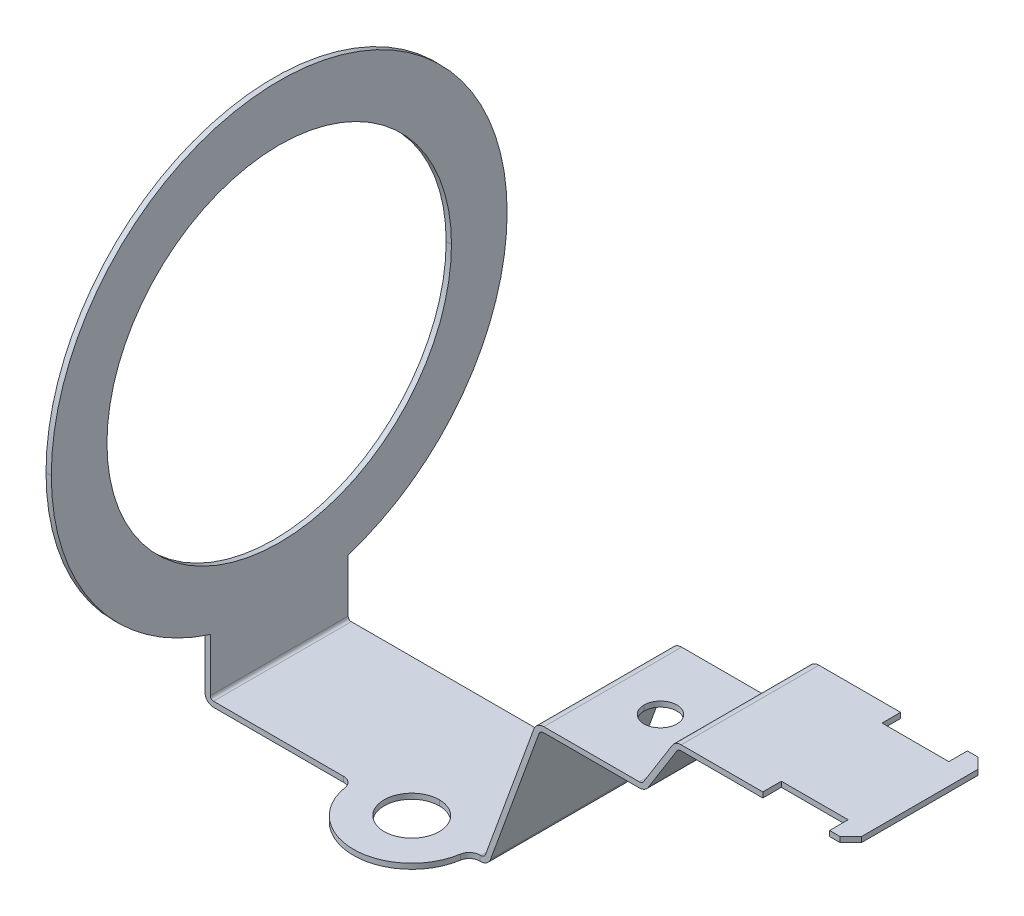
ISO-10303-21;
HEADER;
FILE_DESCRIPTION(('STEP AP214'),'2;1');
FILE_NAME('part.step','',(''),(''),'','','');
FILE_SCHEMA(('AUTOMOTIVE_DESIGN { 1 0 10303 214 1 1 1 1 }'));
ENDSEC;
DATA;
#1=APPLICATION_CONTEXT('core data for automotive mechanical design processes');
#2=APPLICATION_PROTOCOL_DEFINITION('international standard','automotive_design',2000,#1);
#3=PRODUCT_CONTEXT('',#1,'mechanical');
#4=PRODUCT('Part','Part','',(#3));
#5=PRODUCT_RELATED_PRODUCT_CATEGORY('part','',(#4));
#6=PRODUCT_DEFINITION_FORMATION('','',#4);
#7=PRODUCT_DEFINITION_CONTEXT('part definition',#1,'design');
#8=PRODUCT_DEFINITION('design','',#6,#7);
#9=PRODUCT_DEFINITION_SHAPE('','',#8);
#10=(LENGTH_UNIT() NAMED_UNIT(*) SI_UNIT(.MILLI.,.METRE.));
#11=(NAMED_UNIT(*) PLANE_ANGLE_UNIT() SI_UNIT($,.RADIAN.));
#12=(NAMED_UNIT(*) SI_UNIT($,.STERADIAN.) SOLID_ANGLE_UNIT());
#13=UNCERTAINTY_MEASURE_WITH_UNIT(LENGTH_MEASURE(1.E-05),#10,'distance_accuracy_value','');
#14=(GEOMETRIC_REPRESENTATION_CONTEXT(3) GLOBAL_UNCERTAINTY_ASSIGNED_CONTEXT((#13)) GLOBAL_UNIT_ASSIGNED_CONTEXT((#10,
#11,#12)) REPRESENTATION_CONTEXT('',''));
#15=CARTESIAN_POINT('',(0.,0.,0.));
#16=DIRECTION('',(0.,0.,1.));
#17=DIRECTION('',(1.,0.,0.));
#18=AXIS2_PLACEMENT_3D('',#15,#16,#17);
#19=CARTESIAN_POINT('',(25.9226162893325,-41.8502507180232,7.5));
#20=DIRECTION('',(0.,1.,0.));
#21=DIRECTION('',(-1.,0.,0.));
#22=AXIS2_PLACEMENT_3D('',#19,#20,#21);
#23=CYLINDRICAL_SURFACE('',#22,1.);
#24=CARTESIAN_POINT('',(25.9226162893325,-26.2939015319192,7.5));
#25=DIRECTION('',(0.,1.,0.));
#26=DIRECTION('',(0.,0.,1.));
#27=AXIS2_PLACEMENT_3D('',#24,#25,#26);
#28=CIRCLE('',#27,1.);
#29=CARTESIAN_POINT('',(25.9226162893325,-26.2939015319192,6.5));
#30=VERTEX_POINT('',#29);
#31=CARTESIAN_POINT('',(24.9345214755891,-26.2939015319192,7.34615384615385));
#32=VERTEX_POINT('',#31);
#33=EDGE_CURVE('E445',#30,#32,#28,.T.);
#34=ORIENTED_EDGE('',*,*,#33,.F.);
#35=DIRECTION('',(0.,-1.,0.));
#36=VECTOR('',#35,1.);
#37=CARTESIAN_POINT('',(25.9226162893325,-26.2939015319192,6.5));
#38=LINE('',#37,#36);
#39=CARTESIAN_POINT('',(25.9226162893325,-25.7939015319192,6.5));
#40=VERTEX_POINT('',#39);
#41=EDGE_CURVE('E599',#40,#30,#38,.T.);
#42=ORIENTED_EDGE('',*,*,#41,.F.);
#43=CARTESIAN_POINT('',(25.9226162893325,-25.7939015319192,7.5));
#44=DIRECTION('',(0.,-1.,0.));
#45=DIRECTION('',(1.,0.,0.));
#46=AXIS2_PLACEMENT_3D('',#43,#44,#45);
#47=CIRCLE('',#46,1.);
#48=CARTESIAN_POINT('',(24.9345214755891,-25.7939015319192,7.34615384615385));
#49=VERTEX_POINT('',#48);
#50=EDGE_CURVE('E656',#49,#40,#47,.T.);
#51=ORIENTED_EDGE('',*,*,#50,.F.);
#52=DIRECTION('',(0.,1.,0.));
#53=VECTOR('',#52,1.);
#54=CARTESIAN_POINT('',(24.9345214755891,-41.8502507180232,7.34615384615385));
#55=LINE('',#54,#53);
#56=EDGE_CURVE('E11',#32,#49,#55,.T.);
#57=ORIENTED_EDGE('',*,*,#56,.F.);
#58=EDGE_LOOP('',(#34,#42,#51,#57));
#59=FACE_BOUND('',#58,.T.);
#60=ADVANCED_FACE('F16',(#59),#23,.F.);
#61=CARTESIAN_POINT('',(13.0773837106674,-41.8502507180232,7.5));
#62=DIRECTION('',(0.,1.,0.));
#63=DIRECTION('',(-1.,0.,0.));
#64=AXIS2_PLACEMENT_3D('',#61,#62,#63);
#65=CYLINDRICAL_SURFACE('',#64,1.);
#66=CARTESIAN_POINT('',(13.0773837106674,-25.7939015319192,7.5));
#67=DIRECTION('',(0.,-1.,0.));
#68=DIRECTION('',(1.,0.,0.));
#69=AXIS2_PLACEMENT_3D('',#66,#67,#68);
#70=CIRCLE('',#69,1.);
#71=CARTESIAN_POINT('',(13.0773837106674,-25.7939015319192,6.5));
#72=VERTEX_POINT('',#71);
#73=CARTESIAN_POINT('',(14.0654785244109,-25.7939015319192,7.34615384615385));
#74=VERTEX_POINT('',#73);
#75=EDGE_CURVE('E620',#72,#74,#70,.T.);
#76=ORIENTED_EDGE('',*,*,#75,.F.);
#77=DIRECTION('',(0.,1.,0.));
#78=VECTOR('',#77,1.);
#79=CARTESIAN_POINT('',(13.0773837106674,-25.7939015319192,6.5));
#80=LINE('',#79,#78);
#81=CARTESIAN_POINT('',(13.0773837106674,-26.2939015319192,6.5));
#82=VERTEX_POINT('',#81);
#83=EDGE_CURVE('E709',#82,#72,#80,.T.);
#84=ORIENTED_EDGE('',*,*,#83,.F.);
#85=CARTESIAN_POINT('',(13.0773837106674,-26.2939015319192,7.5));
#86=DIRECTION('',(0.,1.,0.));
#87=DIRECTION('',(0.,0.,1.));
#88=AXIS2_PLACEMENT_3D('',#85,#86,#87);
#89=CIRCLE('',#88,1.);
#90=CARTESIAN_POINT('',(14.0654785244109,-26.2939015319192,7.34615384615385));
#91=VERTEX_POINT('',#90);
#92=EDGE_CURVE('E460',#91,#82,#89,.T.);
#93=ORIENTED_EDGE('',*,*,#92,.F.);
#94=DIRECTION('',(0.,-1.,0.));
#95=VECTOR('',#94,1.);
#96=CARTESIAN_POINT('',(14.0654785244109,-41.8502507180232,7.34615384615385));
#97=LINE('',#96,#95);
#98=EDGE_CURVE('E24',#74,#91,#97,.T.);
#99=ORIENTED_EDGE('',*,*,#98,.F.);
#100=EDGE_LOOP('',(#76,#84,#93,#99));
#101=FACE_BOUND('',#100,.T.);
#102=ADVANCED_FACE('F1332',(#101),#65,.F.);
#103=CARTESIAN_POINT('',(36.4639094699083,-26.2939015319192,0.));
#104=DIRECTION('',(0.,1.,0.));
#105=DIRECTION('',(-1.,0.,0.));
#106=AXIS2_PLACEMENT_3D('',#103,#104,#105);
#107=CYLINDRICAL_SURFACE('',#106,1.55);
#108=DIRECTION('',(0.,1.,0.));
#109=VECTOR('',#108,1.);
#110=CARTESIAN_POINT('',(38.0139094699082,-26.2939015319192,0.));
#111=LINE('',#110,#109);
#112=CARTESIAN_POINT('',(38.0139094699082,-12.7939015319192,0.));
#113=VERTEX_POINT('',#112);
#114=CARTESIAN_POINT('',(38.0139094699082,-12.2939015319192,0.));
#115=VERTEX_POINT('',#114);
#116=EDGE_CURVE('E413',#113,#115,#111,.T.);
#117=ORIENTED_EDGE('',*,*,#116,.F.);
#118=CARTESIAN_POINT('',(36.4639094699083,-12.7939015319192,0.));
#119=DIRECTION('',(0.,1.,0.));
#120=DIRECTION('',(-1.,0.,0.));
#121=AXIS2_PLACEMENT_3D('',#118,#119,#120);
#122=CIRCLE('',#121,1.55);
#123=CARTESIAN_POINT('',(34.9139094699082,-12.7939015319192,0.));
#124=VERTEX_POINT('',#123);
#125=EDGE_CURVE('E399',#124,#113,#122,.T.);
#126=ORIENTED_EDGE('',*,*,#125,.F.);
#127=DIRECTION('',(0.,1.,0.));
#128=VECTOR('',#127,1.);
#129=CARTESIAN_POINT('',(34.9139094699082,-26.2939015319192,0.));
#130=LINE('',#129,#128);
#131=CARTESIAN_POINT('',(34.9139094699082,-12.2939015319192,0.));
#132=VERTEX_POINT('',#131);
#133=EDGE_CURVE('E423',#124,#132,#130,.T.);
#134=ORIENTED_EDGE('',*,*,#133,.T.);
#135=CARTESIAN_POINT('',(36.4639094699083,-12.2939015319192,0.));
#136=DIRECTION('',(0.,1.,0.));
#137=DIRECTION('',(-1.,0.,0.));
#138=AXIS2_PLACEMENT_3D('',#135,#136,#137);
#139=CIRCLE('',#138,1.55);
#140=EDGE_CURVE('E415',#132,#115,#139,.T.);
#141=ORIENTED_EDGE('',*,*,#140,.T.);
#142=EDGE_LOOP('',(#117,#126,#134,#141));
#143=FACE_BOUND('',#142,.T.);
#144=ADVANCED_FACE('F414',(#143),#107,.F.);
#145=CARTESIAN_POINT('',(19.5,-25.7939015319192,6.5));
#146=DIRECTION('',(0.,1.,0.));
#147=DIRECTION('',(0.,0.,1.));
#148=AXIS2_PLACEMENT_3D('',#145,#146,#147);
#149=CYLINDRICAL_SURFACE('',#148,2.6);
#150=DIRECTION('',(0.,1.,0.));
#151=VECTOR('',#150,1.);
#152=CARTESIAN_POINT('',(19.5,-25.7939015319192,3.9));
#153=LINE('',#152,#151);
#154=CARTESIAN_POINT('',(19.5,-26.2939015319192,3.9));
#155=VERTEX_POINT('',#154);
#156=CARTESIAN_POINT('',(19.5,-25.7939015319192,3.9));
#157=VERTEX_POINT('',#156);
#158=EDGE_CURVE('E478',#155,#157,#153,.T.);
#159=ORIENTED_EDGE('',*,*,#158,.F.);
#160=CARTESIAN_POINT('',(19.5,-26.2939015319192,6.5));
#161=DIRECTION('',(0.,1.,0.));
#162=DIRECTION('',(0.,0.,1.));
#163=AXIS2_PLACEMENT_3D('',#160,#161,#162);
#164=CIRCLE('',#163,2.6);
#165=CARTESIAN_POINT('',(19.5,-26.2939015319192,9.1));
#166=VERTEX_POINT('',#165);
#167=EDGE_CURVE('E901',#166,#155,#164,.T.);
#168=ORIENTED_EDGE('',*,*,#167,.F.);
#169=DIRECTION('',(0.,1.,0.));
#170=VECTOR('',#169,1.);
#171=CARTESIAN_POINT('',(19.5,-25.7939015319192,9.1));
#172=LINE('',#171,#170);
#173=CARTESIAN_POINT('',(19.5,-25.7939015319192,9.1));
#174=VERTEX_POINT('',#173);
#175=EDGE_CURVE('E513',#166,#174,#172,.T.);
#176=ORIENTED_EDGE('',*,*,#175,.T.);
#177=CARTESIAN_POINT('',(19.5,-25.7939015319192,6.5));
#178=DIRECTION('',(0.,1.,0.));
#179=DIRECTION('',(0.,0.,1.));
#180=AXIS2_PLACEMENT_3D('',#177,#178,#179);
#181=CIRCLE('',#180,2.6);
#182=EDGE_CURVE('E887',#174,#157,#181,.T.);
#183=ORIENTED_EDGE('',*,*,#182,.T.);
#184=EDGE_LOOP('',(#159,#168,#176,#183));
#185=FACE_BOUND('',#184,.T.);
#186=ADVANCED_FACE('F1316',(#185),#149,.F.);
#187=CARTESIAN_POINT('',(19.5,-41.8502507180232,6.5));
#188=DIRECTION('',(0.,1.,0.));
#189=DIRECTION('',(-1.,0.,0.));
#190=AXIS2_PLACEMENT_3D('',#187,#188,#189);
#191=CYLINDRICAL_SURFACE('',#190,5.5);
#192=CARTESIAN_POINT('',(19.5,-25.7939015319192,6.5));
#193=DIRECTION('',(0.,1.,0.));
#194=DIRECTION('',(-1.,0.,0.));
#195=AXIS2_PLACEMENT_3D('',#192,#193,#194);
#196=CIRCLE('',#195,5.5);
#197=EDGE_CURVE('E812',#74,#49,#196,.T.);
#198=ORIENTED_EDGE('',*,*,#197,.F.);
#199=ORIENTED_EDGE('',*,*,#98,.T.);
#200=CARTESIAN_POINT('',(19.5,-26.2939015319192,6.5));
#201=DIRECTION('',(0.,-1.,0.));
#202=DIRECTION('',(0.,0.,1.));
#203=AXIS2_PLACEMENT_3D('',#200,#201,#202);
#204=CIRCLE('',#203,5.5);
#205=EDGE_CURVE('E449',#32,#91,#204,.T.);
#206=ORIENTED_EDGE('',*,*,#205,.F.);
#207=ORIENTED_EDGE('',*,*,#56,.T.);
#208=EDGE_LOOP('',(#198,#199,#206,#207));
#209=FACE_BOUND('',#208,.T.);
#210=ADVANCED_FACE('F1307',(#209),#191,.T.);
#211=CARTESIAN_POINT('',(59.919719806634,-25.2939015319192,6.5));
#212=DIRECTION('',(0.707106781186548,0.,0.707106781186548));
#213=DIRECTION('',(0.,-1.,0.));
#214=AXIS2_PLACEMENT_3D('',#211,#212,#213);
#215=PLANE('',#214);
#216=DIRECTION('',(-0.707106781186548,0.,0.707106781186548));
#217=VECTOR('',#216,1.);
#218=CARTESIAN_POINT('',(59.919719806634,-7.7939015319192,6.5));
#219=LINE('',#218,#217);
#220=CARTESIAN_POINT('',(60.919719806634,-7.7939015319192,5.5));
#221=VERTEX_POINT('',#220);
#222=CARTESIAN_POINT('',(59.919719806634,-7.7939015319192,6.5));
#223=VERTEX_POINT('',#222);
#224=EDGE_CURVE('E557',#221,#223,#219,.T.);
#225=ORIENTED_EDGE('',*,*,#224,.F.);
#226=DIRECTION('',(0.,-1.,0.));
#227=VECTOR('',#226,1.);
#228=CARTESIAN_POINT('',(60.919719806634,-7.7939015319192,5.5));
#229=LINE('',#228,#227);
#230=CARTESIAN_POINT('',(60.919719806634,-7.29390153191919,5.5));
#231=VERTEX_POINT('',#230);
#232=EDGE_CURVE('E772',#231,#221,#229,.T.);
#233=ORIENTED_EDGE('',*,*,#232,.F.);
#234=DIRECTION('',(0.707106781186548,0.,-0.707106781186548));
#235=VECTOR('',#234,1.);
#236=CARTESIAN_POINT('',(59.919719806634,-7.2939015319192,6.5));
#237=LINE('',#236,#235);
#238=CARTESIAN_POINT('',(59.919719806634,-7.29390153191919,6.5));
#239=VERTEX_POINT('',#238);
#240=EDGE_CURVE('E529',#239,#231,#237,.T.);
#241=ORIENTED_EDGE('',*,*,#240,.F.);
#242=DIRECTION('',(0.,1.,0.));
#243=VECTOR('',#242,1.);
#244=CARTESIAN_POINT('',(59.919719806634,-7.29390153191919,6.5));
#245=LINE('',#244,#243);
#246=EDGE_CURVE('E904',#223,#239,#245,.T.);
#247=ORIENTED_EDGE('',*,*,#246,.F.);
#248=EDGE_LOOP('',(#225,#233,#241,#247));
#249=FACE_BOUND('',#248,.T.);
#250=ADVANCED_FACE('F1298',(#249),#215,.T.);
#251=CARTESIAN_POINT('',(60.919719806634,-7.7939015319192,-5.5));
#252=DIRECTION('',(-0.707106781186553,0.,0.707106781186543));
#253=DIRECTION('',(0.,1.,0.));
#254=AXIS2_PLACEMENT_3D('',#251,#252,#253);
#255=PLANE('',#254);
#256=DIRECTION('',(0.707106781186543,0.,0.707106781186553));
#257=VECTOR('',#256,1.);
#258=CARTESIAN_POINT('',(60.919719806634,-7.7939015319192,-5.5));
#259=LINE('',#258,#257);
#260=CARTESIAN_POINT('',(59.919719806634,-7.7939015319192,-6.5));
#261=VERTEX_POINT('',#260);
#262=CARTESIAN_POINT('',(60.919719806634,-7.7939015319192,-5.5));
#263=VERTEX_POINT('',#262);
#264=EDGE_CURVE('E558',#261,#263,#259,.T.);
#265=ORIENTED_EDGE('',*,*,#264,.F.);
#266=DIRECTION('',(0.,-1.,0.));
#267=VECTOR('',#266,1.);
#268=CARTESIAN_POINT('',(59.919719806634,-25.2939015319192,-6.5));
#269=LINE('',#268,#267);
#270=CARTESIAN_POINT('',(59.919719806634,-7.29390153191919,-6.5));
#271=VERTEX_POINT('',#270);
#272=EDGE_CURVE('E572',#271,#261,#269,.T.);
#273=ORIENTED_EDGE('',*,*,#272,.F.);
#274=DIRECTION('',(-0.707106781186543,0.,-0.707106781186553));
#275=VECTOR('',#274,1.);
#276=CARTESIAN_POINT('',(60.919719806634,-7.29390153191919,-5.5));
#277=LINE('',#276,#275);
#278=CARTESIAN_POINT('',(60.919719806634,-7.29390153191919,-5.5));
#279=VERTEX_POINT('',#278);
#280=EDGE_CURVE('E492',#279,#271,#277,.T.);
#281=ORIENTED_EDGE('',*,*,#280,.F.);
#282=DIRECTION('',(0.,1.,0.));
#283=VECTOR('',#282,1.);
#284=CARTESIAN_POINT('',(60.919719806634,-7.7939015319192,-5.5));
#285=LINE('',#284,#283);
#286=EDGE_CURVE('E836',#263,#279,#285,.T.);
#287=ORIENTED_EDGE('',*,*,#286,.F.);
#288=EDGE_LOOP('',(#265,#273,#281,#287));
#289=FACE_BOUND('',#288,.T.);
#290=ADVANCED_FACE('F933',(#289),#255,.F.);
#291=CARTESIAN_POINT('',(58.919719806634,-17.2939015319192,6.5));
#292=DIRECTION('',(1.,0.,0.));
#293=DIRECTION('',(0.,1.,0.));
#294=AXIS2_PLACEMENT_3D('',#291,#292,#293);
#295=PLANE('',#294);
#296=DIRECTION('',(0.,1.,0.));
#297=VECTOR('',#296,1.);
#298=CARTESIAN_POINT('',(58.919719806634,-25.2939015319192,6.5));
#299=LINE('',#298,#297);
#300=CARTESIAN_POINT('',(58.919719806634,-7.7939015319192,6.5));
#301=VERTEX_POINT('',#300);
#302=CARTESIAN_POINT('',(58.919719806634,-7.29390153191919,6.5));
#303=VERTEX_POINT('',#302);
#304=EDGE_CURVE('E907',#301,#303,#299,.T.);
#305=ORIENTED_EDGE('',*,*,#304,.T.);
#306=DIRECTION('',(0.,0.,-1.));
#307=VECTOR('',#306,1.);
#308=CARTESIAN_POINT('',(58.919719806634,-7.29390153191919,6.5));
#309=LINE('',#308,#307);
#310=CARTESIAN_POINT('',(58.919719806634,-7.29390153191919,4.75));
#311=VERTEX_POINT('',#310);
#312=EDGE_CURVE('E717',#303,#311,#309,.T.);
#313=ORIENTED_EDGE('',*,*,#312,.T.);
#314=DIRECTION('',(0.,1.,0.));
#315=VECTOR('',#314,1.);
#316=CARTESIAN_POINT('',(58.919719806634,-17.2939015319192,4.75));
#317=LINE('',#316,#315);
#318=CARTESIAN_POINT('',(58.919719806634,-7.7939015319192,4.75));
#319=VERTEX_POINT('',#318);
#320=EDGE_CURVE('E919',#319,#311,#317,.T.);
#321=ORIENTED_EDGE('',*,*,#320,.F.);
#322=DIRECTION('',(0.,0.,-1.));
#323=VECTOR('',#322,1.);
#324=CARTESIAN_POINT('',(58.919719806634,-7.7939015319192,6.5));
#325=LINE('',#324,#323);
#326=EDGE_CURVE('E741',#301,#319,#325,.T.);
#327=ORIENTED_EDGE('',*,*,#326,.F.);
#328=EDGE_LOOP('',(#305,#313,#321,#327));
#329=FACE_BOUND('',#328,.T.);
#330=ADVANCED_FACE('F928',(#329),#295,.F.);
#331=CARTESIAN_POINT('',(52.619719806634,-17.2939015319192,6.5));
#332=DIRECTION('',(-1.,0.,0.));
#333=DIRECTION('',(0.,1.,0.));
#334=AXIS2_PLACEMENT_3D('',#331,#332,#333);
#335=PLANE('',#334);
#336=DIRECTION('',(0.,1.,0.));
#337=VECTOR('',#336,1.);
#338=CARTESIAN_POINT('',(52.619719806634,-17.2939015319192,4.75));
#339=LINE('',#338,#337);
#340=CARTESIAN_POINT('',(52.619719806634,-7.7939015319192,4.75));
#341=VERTEX_POINT('',#340);
#342=CARTESIAN_POINT('',(52.619719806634,-7.29390153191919,4.75));
#343=VERTEX_POINT('',#342);
#344=EDGE_CURVE('E922',#341,#343,#339,.T.);
#345=ORIENTED_EDGE('',*,*,#344,.T.);
#346=DIRECTION('',(0.,0.,1.));
#347=VECTOR('',#346,1.);
#348=CARTESIAN_POINT('',(52.619719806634,-7.29390153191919,6.5));
#349=LINE('',#348,#347);
#350=CARTESIAN_POINT('',(52.619719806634,-7.29390153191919,6.5));
#351=VERTEX_POINT('',#350);
#352=EDGE_CURVE('E780',#343,#351,#349,.T.);
#353=ORIENTED_EDGE('',*,*,#352,.T.);
#354=DIRECTION('',(0.,-1.,0.));
#355=VECTOR('',#354,1.);
#356=CARTESIAN_POINT('',(52.619719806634,-25.2939015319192,6.5));
#357=LINE('',#356,#355);
#358=CARTESIAN_POINT('',(52.619719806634,-7.7939015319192,6.5));
#359=VERTEX_POINT('',#358);
#360=EDGE_CURVE('E667',#351,#359,#357,.T.);
#361=ORIENTED_EDGE('',*,*,#360,.T.);
#362=DIRECTION('',(0.,0.,1.));
#363=VECTOR('',#362,1.);
#364=CARTESIAN_POINT('',(52.619719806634,-7.79390153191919,6.5));
#365=LINE('',#364,#363);
#366=EDGE_CURVE('E756',#341,#359,#365,.T.);
#367=ORIENTED_EDGE('',*,*,#366,.F.);
#368=EDGE_LOOP('',(#345,#353,#361,#367));
#369=FACE_BOUND('',#368,.T.);
#370=ADVANCED_FACE('F932',(#369),#335,.F.);
#371=CARTESIAN_POINT('',(52.619719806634,-17.2939015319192,4.75));
#372=DIRECTION('',(0.,0.,-1.));
#373=DIRECTION('',(-1.,0.,0.));
#374=AXIS2_PLACEMENT_3D('',#371,#372,#373);
#375=PLANE('',#374);
#376=ORIENTED_EDGE('',*,*,#320,.T.);
#377=DIRECTION('',(-1.,0.,0.));
#378=VECTOR('',#377,1.);
#379=CARTESIAN_POINT('',(52.619719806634,-7.29390153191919,4.75));
#380=LINE('',#379,#378);
#381=EDGE_CURVE('E783',#311,#343,#380,.T.);
#382=ORIENTED_EDGE('',*,*,#381,.T.);
#383=ORIENTED_EDGE('',*,*,#344,.F.);
#384=DIRECTION('',(-1.,0.,0.));
#385=VECTOR('',#384,1.);
#386=CARTESIAN_POINT('',(44.919719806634,-7.79390153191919,4.75));
#387=LINE('',#386,#385);
#388=EDGE_CURVE('E745',#319,#341,#387,.T.);
#389=ORIENTED_EDGE('',*,*,#388,.F.);
#390=EDGE_LOOP('',(#376,#382,#383,#389));
#391=FACE_BOUND('',#390,.T.);
#392=ADVANCED_FACE('F1275',(#391),#375,.F.);
#393=CARTESIAN_POINT('',(52.619719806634,-17.2939015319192,-6.5));
#394=DIRECTION('',(-1.,0.,0.));
#395=DIRECTION('',(0.,1.,0.));
#396=AXIS2_PLACEMENT_3D('',#393,#394,#395);
#397=PLANE('',#396);
#398=DIRECTION('',(0.,-1.,0.));
#399=VECTOR('',#398,1.);
#400=CARTESIAN_POINT('',(52.619719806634,-25.2939015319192,-6.5));
#401=LINE('',#400,#399);
#402=CARTESIAN_POINT('',(52.619719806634,-7.29390153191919,-6.5));
#403=VERTEX_POINT('',#402);
#404=CARTESIAN_POINT('',(52.619719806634,-7.79390153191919,-6.5));
#405=VERTEX_POINT('',#404);
#406=EDGE_CURVE('E910',#403,#405,#401,.T.);
#407=ORIENTED_EDGE('',*,*,#406,.F.);
#408=DIRECTION('',(0.,0.,1.));
#409=VECTOR('',#408,1.);
#410=CARTESIAN_POINT('',(52.619719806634,-7.29390153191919,-6.5));
#411=LINE('',#410,#409);
#412=CARTESIAN_POINT('',(52.619719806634,-7.29390153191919,-4.75));
#413=VERTEX_POINT('',#412);
#414=EDGE_CURVE('E517',#403,#413,#411,.T.);
#415=ORIENTED_EDGE('',*,*,#414,.T.);
#416=DIRECTION('',(0.,1.,0.));
#417=VECTOR('',#416,1.);
#418=CARTESIAN_POINT('',(52.619719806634,-17.2939015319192,-4.75));
#419=LINE('',#418,#417);
#420=CARTESIAN_POINT('',(52.619719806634,-7.7939015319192,-4.75));
#421=VERTEX_POINT('',#420);
#422=EDGE_CURVE('E913',#421,#413,#419,.T.);
#423=ORIENTED_EDGE('',*,*,#422,.F.);
#424=DIRECTION('',(0.,0.,1.));
#425=VECTOR('',#424,1.);
#426=CARTESIAN_POINT('',(52.619719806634,-7.79390153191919,6.5));
#427=LINE('',#426,#425);
#428=EDGE_CURVE('E825',#405,#421,#427,.T.);
#429=ORIENTED_EDGE('',*,*,#428,.F.);
#430=EDGE_LOOP('',(#407,#415,#423,#429));
#431=FACE_BOUND('',#430,.T.);
#432=ADVANCED_FACE('F1266',(#431),#397,.F.);
#433=CARTESIAN_POINT('',(58.919719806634,-17.2939015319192,-6.5));
#434=DIRECTION('',(1.,0.,0.));
#435=DIRECTION('',(0.,1.,0.));
#436=AXIS2_PLACEMENT_3D('',#433,#434,#435);
#437=PLANE('',#436);
#438=DIRECTION('',(0.,1.,0.));
#439=VECTOR('',#438,1.);
#440=CARTESIAN_POINT('',(58.919719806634,-17.2939015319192,-4.75));
#441=LINE('',#440,#439);
#442=CARTESIAN_POINT('',(58.919719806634,-7.7939015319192,-4.75));
#443=VERTEX_POINT('',#442);
#444=CARTESIAN_POINT('',(58.919719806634,-7.29390153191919,-4.75));
#445=VERTEX_POINT('',#444);
#446=EDGE_CURVE('E916',#443,#445,#441,.T.);
#447=ORIENTED_EDGE('',*,*,#446,.T.);
#448=DIRECTION('',(0.,0.,-1.));
#449=VECTOR('',#448,1.);
#450=CARTESIAN_POINT('',(58.919719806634,-7.29390153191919,-6.5));
#451=LINE('',#450,#449);
#452=CARTESIAN_POINT('',(58.919719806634,-7.29390153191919,-6.5));
#453=VERTEX_POINT('',#452);
#454=EDGE_CURVE('E488',#445,#453,#451,.T.);
#455=ORIENTED_EDGE('',*,*,#454,.T.);
#456=DIRECTION('',(0.,1.,0.));
#457=VECTOR('',#456,1.);
#458=CARTESIAN_POINT('',(58.919719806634,-25.2939015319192,-6.5));
#459=LINE('',#458,#457);
#460=CARTESIAN_POINT('',(58.919719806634,-7.7939015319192,-6.5));
#461=VERTEX_POINT('',#460);
#462=EDGE_CURVE('E571',#461,#453,#459,.T.);
#463=ORIENTED_EDGE('',*,*,#462,.F.);
#464=DIRECTION('',(0.,0.,-1.));
#465=VECTOR('',#464,1.);
#466=CARTESIAN_POINT('',(58.919719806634,-7.7939015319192,6.5));
#467=LINE('',#466,#465);
#468=EDGE_CURVE('E833',#443,#461,#467,.T.);
#469=ORIENTED_EDGE('',*,*,#468,.F.);
#470=EDGE_LOOP('',(#447,#455,#463,#469));
#471=FACE_BOUND('',#470,.T.);
#472=ADVANCED_FACE('F1257',(#471),#437,.F.);
#473=CARTESIAN_POINT('',(58.919719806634,-17.2939015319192,-4.75));
#474=DIRECTION('',(0.,0.,1.));
#475=DIRECTION('',(1.,0.,0.));
#476=AXIS2_PLACEMENT_3D('',#473,#474,#475);
#477=PLANE('',#476);
#478=ORIENTED_EDGE('',*,*,#422,.T.);
#479=DIRECTION('',(1.,0.,0.));
#480=VECTOR('',#479,1.);
#481=CARTESIAN_POINT('',(58.919719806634,-7.29390153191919,-4.75));
#482=LINE('',#481,#480);
#483=EDGE_CURVE('E491',#413,#445,#482,.T.);
#484=ORIENTED_EDGE('',*,*,#483,.T.);
#485=ORIENTED_EDGE('',*,*,#446,.F.);
#486=DIRECTION('',(1.,0.,0.));
#487=VECTOR('',#486,1.);
#488=CARTESIAN_POINT('',(44.919719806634,-7.79390153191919,-4.75));
#489=LINE('',#488,#487);
#490=EDGE_CURVE('E829',#421,#443,#489,.T.);
#491=ORIENTED_EDGE('',*,*,#490,.F.);
#492=EDGE_LOOP('',(#478,#484,#485,#491));
#493=FACE_BOUND('',#492,.T.);
#494=ADVANCED_FACE('F1248',(#493),#477,.F.);
#495=CARTESIAN_POINT('',(26.,-25.2939015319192,-6.5));
#496=DIRECTION('',(0.,0.,1.));
#497=DIRECTION('',(1.,0.,0.));
#498=AXIS2_PLACEMENT_3D('',#495,#496,#497);
#499=PLANE('',#498);
#500=DIRECTION('',(-1.,0.,0.));
#501=VECTOR('',#500,1.);
#502=CARTESIAN_POINT('',(60.919719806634,-7.29390153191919,-6.5));
#503=LINE('',#502,#501);
#504=CARTESIAN_POINT('',(44.919719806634,-7.2939015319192,-6.5));
#505=VERTEX_POINT('',#504);
#506=EDGE_CURVE('E849',#403,#505,#503,.T.);
#507=ORIENTED_EDGE('',*,*,#506,.F.);
#508=ORIENTED_EDGE('',*,*,#406,.T.);
#509=DIRECTION('',(1.,0.,0.));
#510=VECTOR('',#509,1.);
#511=CARTESIAN_POINT('',(44.919719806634,-7.79390153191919,-6.5));
#512=LINE('',#511,#510);
#513=CARTESIAN_POINT('',(44.919719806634,-7.7939015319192,-6.5));
#514=VERTEX_POINT('',#513);
#515=EDGE_CURVE('E764',#514,#405,#512,.T.);
#516=ORIENTED_EDGE('',*,*,#515,.F.);
#517=CARTESIAN_POINT('',(44.919719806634,-8.2939015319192,-6.5));
#518=DIRECTION('',(0.,0.,-1.));
#519=DIRECTION('',(-1.,0.,0.));
#520=AXIS2_PLACEMENT_3D('',#517,#518,#519);
#521=CIRCLE('',#520,0.500000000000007);
#522=CARTESIAN_POINT('',(44.4956957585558,-8.0289418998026,-6.5));
#523=VERTEX_POINT('',#522);
#524=EDGE_CURVE('E437',#523,#514,#521,.T.);
#525=ORIENTED_EDGE('',*,*,#524,.F.);
#526=DIRECTION('',(0.5299192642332,0.848048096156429,0.));
#527=VECTOR('',#526,1.);
#528=CARTESIAN_POINT('',(41.8119575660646,-12.3238207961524,-6.5));
#529=LINE('',#528,#527);
#530=CARTESIAN_POINT('',(41.8119575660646,-12.3238207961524,-6.5));
#531=VERTEX_POINT('',#530);
#532=EDGE_CURVE('E438',#531,#523,#529,.T.);
#533=ORIENTED_EDGE('',*,*,#532,.F.);
#534=CARTESIAN_POINT('',(40.9639094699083,-11.7939015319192,-6.5));
#535=DIRECTION('',(0.,0.,1.));
#536=DIRECTION('',(1.,0.,0.));
#537=AXIS2_PLACEMENT_3D('',#534,#535,#536);
#538=CIRCLE('',#537,1.);
#539=CARTESIAN_POINT('',(40.9639094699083,-12.7939015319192,-6.5));
#540=VERTEX_POINT('',#539);
#541=EDGE_CURVE('E409',#540,#531,#538,.T.);
#542=ORIENTED_EDGE('',*,*,#541,.F.);
#543=DIRECTION('',(1.,0.,0.));
#544=VECTOR('',#543,1.);
#545=CARTESIAN_POINT('',(31.9639094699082,-12.7939015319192,-6.5));
#546=LINE('',#545,#544);
#547=CARTESIAN_POINT('',(31.9639094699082,-12.7939015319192,-6.5));
#548=VERTEX_POINT('',#547);
#549=EDGE_CURVE('E479',#548,#540,#546,.T.);
#550=ORIENTED_EDGE('',*,*,#549,.F.);
#551=CARTESIAN_POINT('',(31.9639094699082,-13.2939015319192,-6.5));
#552=DIRECTION('',(0.,0.,-1.));
#553=DIRECTION('',(-1.,0.,0.));
#554=AXIS2_PLACEMENT_3D('',#551,#552,#553);
#555=CIRCLE('',#554,0.500000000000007);
#556=CARTESIAN_POINT('',(31.4940631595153,-13.1228914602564,-6.5));
#557=VERTEX_POINT('',#556);
#558=EDGE_CURVE('E779',#557,#548,#555,.T.);
#559=ORIENTED_EDGE('',*,*,#558,.F.);
#560=DIRECTION('',(0.342020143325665,0.93969262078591,0.));
#561=VECTOR('',#560,1.);
#562=CARTESIAN_POINT('',(26.9396926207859,-25.6359216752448,-6.5));
#563=LINE('',#562,#561);
#564=CARTESIAN_POINT('',(26.9396926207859,-25.6359216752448,-6.5));
#565=VERTEX_POINT('',#564);
#566=EDGE_CURVE('E461',#565,#557,#563,.T.);
#567=ORIENTED_EDGE('',*,*,#566,.F.);
#568=CARTESIAN_POINT('',(26.,-25.2939015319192,-6.5));
#569=DIRECTION('',(0.,0.,1.));
#570=DIRECTION('',(1.,0.,0.));
#571=AXIS2_PLACEMENT_3D('',#568,#569,#570);
#572=CIRCLE('',#571,1.);
#573=CARTESIAN_POINT('',(26.,-26.2939015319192,-6.5));
#574=VERTEX_POINT('',#573);
#575=EDGE_CURVE('E431',#574,#565,#572,.T.);
#576=ORIENTED_EDGE('',*,*,#575,.F.);
#577=DIRECTION('',(1.,0.,0.));
#578=VECTOR('',#577,1.);
#579=CARTESIAN_POINT('',(0.8,-26.2939015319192,-6.5));
#580=LINE('',#579,#578);
#581=CARTESIAN_POINT('',(0.8,-26.2939015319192,-6.5));
#582=VERTEX_POINT('',#581);
#583=EDGE_CURVE('E898',#582,#574,#580,.T.);
#584=ORIENTED_EDGE('',*,*,#583,.F.);
#585=CARTESIAN_POINT('',(0.8,-25.4939015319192,-6.5));
#586=DIRECTION('',(0.,0.,1.));
#587=DIRECTION('',(1.,0.,0.));
#588=AXIS2_PLACEMENT_3D('',#585,#586,#587);
#589=CIRCLE('',#588,0.8);
#590=CARTESIAN_POINT('',(0.,-25.4939015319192,-6.5));
#591=VERTEX_POINT('',#590);
#592=EDGE_CURVE('E806',#591,#582,#589,.T.);
#593=ORIENTED_EDGE('',*,*,#592,.F.);
#594=DIRECTION('',(0.,-1.,0.));
#595=VECTOR('',#594,1.);
#596=CARTESIAN_POINT('',(0.,-20.4939015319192,-6.5));
#597=LINE('',#596,#595);
#598=CARTESIAN_POINT('',(0.,-20.4939015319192,-6.5));
#599=VERTEX_POINT('',#598);
#600=EDGE_CURVE('E627',#599,#591,#597,.T.);
#601=ORIENTED_EDGE('',*,*,#600,.F.);
#602=DIRECTION('',(-1.,0.,0.));
#603=VECTOR('',#602,1.);
#604=CARTESIAN_POINT('',(0.5,-20.4939015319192,-6.5));
#605=LINE('',#604,#603);
#606=CARTESIAN_POINT('',(0.5,-20.4939015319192,-6.5));
#607=VERTEX_POINT('',#606);
#608=EDGE_CURVE('E659',#607,#599,#605,.T.);
#609=ORIENTED_EDGE('',*,*,#608,.F.);
#610=DIRECTION('',(0.,1.,0.));
#611=VECTOR('',#610,1.);
#612=CARTESIAN_POINT('',(0.5,-25.4939015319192,-6.5));
#613=LINE('',#612,#611);
#614=CARTESIAN_POINT('',(0.5,-25.4939015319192,-6.5));
#615=VERTEX_POINT('',#614);
#616=EDGE_CURVE('E509',#615,#607,#613,.T.);
#617=ORIENTED_EDGE('',*,*,#616,.F.);
#618=CARTESIAN_POINT('',(0.8,-25.4939015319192,-6.5));
#619=DIRECTION('',(0.,0.,-1.));
#620=DIRECTION('',(-1.,0.,0.));
#621=AXIS2_PLACEMENT_3D('',#618,#619,#620);
#622=CIRCLE('',#621,0.3);
#623=CARTESIAN_POINT('',(0.8,-25.7939015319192,-6.5));
#624=VERTEX_POINT('',#623);
#625=EDGE_CURVE('E890',#624,#615,#622,.T.);
#626=ORIENTED_EDGE('',*,*,#625,.F.);
#627=DIRECTION('',(-1.,0.,0.));
#628=VECTOR('',#627,1.);
#629=CARTESIAN_POINT('',(26.,-25.7939015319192,-6.5));
#630=LINE('',#629,#628);
#631=CARTESIAN_POINT('',(26.,-25.7939015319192,-6.5));
#632=VERTEX_POINT('',#631);
#633=EDGE_CURVE('E651',#632,#624,#630,.T.);
#634=ORIENTED_EDGE('',*,*,#633,.F.);
#635=CARTESIAN_POINT('',(26.,-25.2939015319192,-6.5));
#636=DIRECTION('',(0.,0.,-1.));
#637=DIRECTION('',(-1.,0.,0.));
#638=AXIS2_PLACEMENT_3D('',#635,#636,#637);
#639=CIRCLE('',#638,0.500000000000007);
#640=CARTESIAN_POINT('',(26.4698463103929,-25.464911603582,-6.5));
#641=VERTEX_POINT('',#640);
#642=EDGE_CURVE('E594',#641,#632,#639,.T.);
#643=ORIENTED_EDGE('',*,*,#642,.F.);
#644=DIRECTION('',(-0.342020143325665,-0.93969262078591,0.));
#645=VECTOR('',#644,1.);
#646=CARTESIAN_POINT('',(31.0242168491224,-12.9518813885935,-6.5));
#647=LINE('',#646,#645);
#648=CARTESIAN_POINT('',(31.0242168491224,-12.9518813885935,-6.5));
#649=VERTEX_POINT('',#648);
#650=EDGE_CURVE('E595',#649,#641,#647,.T.);
#651=ORIENTED_EDGE('',*,*,#650,.F.);
#652=CARTESIAN_POINT('',(31.9639094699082,-13.2939015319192,-6.5));
#653=DIRECTION('',(0.,0.,1.));
#654=DIRECTION('',(1.,0.,0.));
#655=AXIS2_PLACEMENT_3D('',#652,#653,#654);
#656=CIRCLE('',#655,1.);
#657=CARTESIAN_POINT('',(31.9639094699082,-12.2939015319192,-6.5));
#658=VERTEX_POINT('',#657);
#659=EDGE_CURVE('E581',#658,#649,#656,.T.);
#660=ORIENTED_EDGE('',*,*,#659,.F.);
#661=DIRECTION('',(-1.,0.,0.));
#662=VECTOR('',#661,1.);
#663=CARTESIAN_POINT('',(40.9639094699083,-12.2939015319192,-6.5));
#664=LINE('',#663,#662);
#665=CARTESIAN_POINT('',(40.9639094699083,-12.2939015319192,-6.5));
#666=VERTEX_POINT('',#665);
#667=EDGE_CURVE('E541',#666,#658,#664,.T.);
#668=ORIENTED_EDGE('',*,*,#667,.F.);
#669=CARTESIAN_POINT('',(40.9639094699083,-11.7939015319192,-6.5));
#670=DIRECTION('',(0.,0.,-1.));
#671=DIRECTION('',(-1.,0.,0.));
#672=AXIS2_PLACEMENT_3D('',#669,#670,#671);
#673=CIRCLE('',#672,0.5);
#674=CARTESIAN_POINT('',(41.3879335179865,-12.0588611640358,-6.5));
#675=VERTEX_POINT('',#674);
#676=EDGE_CURVE('E542',#675,#666,#673,.T.);
#677=ORIENTED_EDGE('',*,*,#676,.F.);
#678=DIRECTION('',(-0.529919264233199,-0.84804809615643,0.));
#679=VECTOR('',#678,1.);
#680=CARTESIAN_POINT('',(44.0716717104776,-7.76398226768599,-6.5));
#681=LINE('',#680,#679);
#682=CARTESIAN_POINT('',(44.0716717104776,-7.76398226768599,-6.5));
#683=VERTEX_POINT('',#682);
#684=EDGE_CURVE('E705',#683,#675,#681,.T.);
#685=ORIENTED_EDGE('',*,*,#684,.F.);
#686=CARTESIAN_POINT('',(44.919719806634,-8.29390153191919,-6.5));
#687=DIRECTION('',(0.,0.,1.));
#688=DIRECTION('',(1.,0.,0.));
#689=AXIS2_PLACEMENT_3D('',#686,#687,#688);
#690=CIRCLE('',#689,1.);
#691=EDGE_CURVE('E532',#505,#683,#690,.T.);
#692=ORIENTED_EDGE('',*,*,#691,.F.);
#693=EDGE_LOOP('',(#507,#508,#516,#525,#533,#542,#550,#559,#567,#576,#584,#593,#601,#609,#617,
#626,#634,#643,#651,#660,#668,#677,#685,#692));
#694=FACE_BOUND('',#693,.T.);
#695=ADVANCED_FACE('F1239',(#694),#499,.F.);
#696=CARTESIAN_POINT('',(26.,-25.2939015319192,6.5));
#697=DIRECTION('',(0.,0.,1.));
#698=DIRECTION('',(1.,0.,0.));
#699=AXIS2_PLACEMENT_3D('',#696,#697,#698);
#700=PLANE('',#699);
#701=DIRECTION('',(1.,0.,0.));
#702=VECTOR('',#701,1.);
#703=CARTESIAN_POINT('',(44.919719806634,-7.79390153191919,6.5));
#704=LINE('',#703,#702);
#705=EDGE_CURVE('E746',#301,#223,#704,.T.);
#706=ORIENTED_EDGE('',*,*,#705,.T.);
#707=ORIENTED_EDGE('',*,*,#246,.T.);
#708=DIRECTION('',(-1.,0.,0.));
#709=VECTOR('',#708,1.);
#710=CARTESIAN_POINT('',(60.919719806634,-7.29390153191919,6.5));
#711=LINE('',#710,#709);
#712=EDGE_CURVE('E533',#239,#303,#711,.T.);
#713=ORIENTED_EDGE('',*,*,#712,.T.);
#714=ORIENTED_EDGE('',*,*,#304,.F.);
#715=EDGE_LOOP('',(#706,#707,#713,#714));
#716=FACE_BOUND('',#715,.T.);
#717=ADVANCED_FACE('F1230',(#716),#700,.T.);
#718=CARTESIAN_POINT('',(0.8,-26.2939015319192,6.5));
#719=DIRECTION('',(0.,1.,0.));
#720=DIRECTION('',(1.,0.,0.));
#721=AXIS2_PLACEMENT_3D('',#718,#719,#720);
#722=PLANE('',#721);
#723=ORIENTED_EDGE('',*,*,#167,.T.);
#724=CARTESIAN_POINT('',(19.5,-26.2939015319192,6.5));
#725=DIRECTION('',(0.,1.,0.));
#726=DIRECTION('',(0.,0.,1.));
#727=AXIS2_PLACEMENT_3D('',#724,#725,#726);
#728=CIRCLE('',#727,2.6);
#729=EDGE_CURVE('E468',#155,#166,#728,.T.);
#730=ORIENTED_EDGE('',*,*,#729,.T.);
#731=EDGE_LOOP('',(#723,#730));
#732=FACE_BOUND('',#731,.T.);
#733=DIRECTION('',(1.,0.,0.));
#734=VECTOR('',#733,1.);
#735=CARTESIAN_POINT('',(0.8,-26.2939015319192,6.5));
#736=LINE('',#735,#734);
#737=CARTESIAN_POINT('',(26.,-26.2939015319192,6.5));
#738=VERTEX_POINT('',#737);
#739=EDGE_CURVE('E603',#30,#738,#736,.T.);
#740=ORIENTED_EDGE('',*,*,#739,.F.);
#741=ORIENTED_EDGE('',*,*,#33,.T.);
#742=ORIENTED_EDGE('',*,*,#205,.T.);
#743=ORIENTED_EDGE('',*,*,#92,.T.);
#744=DIRECTION('',(1.,0.,0.));
#745=VECTOR('',#744,1.);
#746=CARTESIAN_POINT('',(0.8,-26.2939015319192,6.5));
#747=LINE('',#746,#745);
#748=CARTESIAN_POINT('',(0.8,-26.2939015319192,6.5));
#749=VERTEX_POINT('',#748);
#750=EDGE_CURVE('E700',#749,#82,#747,.T.);
#751=ORIENTED_EDGE('',*,*,#750,.F.);
#752=DIRECTION('',(0.,0.,-1.));
#753=VECTOR('',#752,1.);
#754=CARTESIAN_POINT('',(0.8,-26.2939015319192,6.5));
#755=LINE('',#754,#753);
#756=EDGE_CURVE('E450',#749,#582,#755,.T.);
#757=ORIENTED_EDGE('',*,*,#756,.T.);
#758=ORIENTED_EDGE('',*,*,#583,.T.);
#759=DIRECTION('',(0.,0.,-1.));
#760=VECTOR('',#759,1.);
#761=CARTESIAN_POINT('',(26.,-26.2939015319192,6.5));
#762=LINE('',#761,#760);
#763=EDGE_CURVE('E430',#738,#574,#762,.T.);
#764=ORIENTED_EDGE('',*,*,#763,.F.);
#765=EDGE_LOOP('',(#740,#741,#742,#743,#751,#757,#758,#764));
#766=FACE_BOUND('',#765,.T.);
#767=ADVANCED_FACE('F1221',(#732,#766),#722,.F.);
#768=CARTESIAN_POINT('',(0.8,-25.4939015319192,6.5));
#769=DIRECTION('',(0.,0.,-1.));
#770=DIRECTION('',(-1.,0.,0.));
#771=AXIS2_PLACEMENT_3D('',#768,#769,#770);
#772=CYLINDRICAL_SURFACE('',#771,0.8);
#773=ORIENTED_EDGE('',*,*,#592,.T.);
#774=ORIENTED_EDGE('',*,*,#756,.F.);
#775=CARTESIAN_POINT('',(0.8,-25.4939015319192,6.5));
#776=DIRECTION('',(0.,0.,1.));
#777=DIRECTION('',(1.,0.,0.));
#778=AXIS2_PLACEMENT_3D('',#775,#776,#777);
#779=CIRCLE('',#778,0.8);
#780=CARTESIAN_POINT('',(0.,-25.4939015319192,6.5));
#781=VERTEX_POINT('',#780);
#782=EDGE_CURVE('E497',#781,#749,#779,.T.);
#783=ORIENTED_EDGE('',*,*,#782,.F.);
#784=DIRECTION('',(0.,0.,-1.));
#785=VECTOR('',#784,1.);
#786=CARTESIAN_POINT('',(0.,-25.4939015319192,6.5));
#787=LINE('',#786,#785);
#788=EDGE_CURVE('E635',#781,#591,#787,.T.);
#789=ORIENTED_EDGE('',*,*,#788,.T.);
#790=EDGE_LOOP('',(#773,#774,#783,#789));
#791=FACE_BOUND('',#790,.T.);
#792=ADVANCED_FACE('F1155',(#791),#772,.T.);
#793=CARTESIAN_POINT('',(0.8,-25.4939015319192,6.5));
#794=DIRECTION('',(0.,0.,-1.));
#795=DIRECTION('',(-1.,0.,0.));
#796=AXIS2_PLACEMENT_3D('',#793,#794,#795);
#797=CYLINDRICAL_SURFACE('',#796,0.3);
#798=ORIENTED_EDGE('',*,*,#625,.T.);
#799=DIRECTION('',(0.,0.,-1.));
#800=VECTOR('',#799,1.);
#801=CARTESIAN_POINT('',(0.5,-25.4939015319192,6.5));
#802=LINE('',#801,#800);
#803=CARTESIAN_POINT('',(0.5,-25.4939015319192,6.5));
#804=VERTEX_POINT('',#803);
#805=EDGE_CURVE('E749',#804,#615,#802,.T.);
#806=ORIENTED_EDGE('',*,*,#805,.F.);
#807=CARTESIAN_POINT('',(0.8,-25.4939015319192,6.5));
#808=DIRECTION('',(0.,0.,-1.));
#809=DIRECTION('',(-1.,0.,0.));
#810=AXIS2_PLACEMENT_3D('',#807,#808,#809);
#811=CIRCLE('',#810,0.3);
#812=CARTESIAN_POINT('',(0.8,-25.7939015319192,6.5));
#813=VERTEX_POINT('',#812);
#814=EDGE_CURVE('E721',#813,#804,#811,.T.);
#815=ORIENTED_EDGE('',*,*,#814,.F.);
#816=DIRECTION('',(0.,0.,-1.));
#817=VECTOR('',#816,1.);
#818=CARTESIAN_POINT('',(0.8,-25.7939015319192,6.5));
#819=LINE('',#818,#817);
#820=EDGE_CURVE('E655',#813,#624,#819,.T.);
#821=ORIENTED_EDGE('',*,*,#820,.T.);
#822=EDGE_LOOP('',(#798,#806,#815,#821));
#823=FACE_BOUND('',#822,.T.);
#824=ADVANCED_FACE('F1150',(#823),#797,.F.);
#825=CARTESIAN_POINT('',(26.,-25.7939015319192,6.5));
#826=DIRECTION('',(0.,-1.,0.));
#827=DIRECTION('',(0.,0.,-1.));
#828=AXIS2_PLACEMENT_3D('',#825,#826,#827);
#829=PLANE('',#828);
#830=ORIENTED_EDGE('',*,*,#182,.F.);
#831=CARTESIAN_POINT('',(19.5,-25.7939015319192,6.5));
#832=DIRECTION('',(0.,1.,0.));
#833=DIRECTION('',(0.,0.,1.));
#834=AXIS2_PLACEMENT_3D('',#831,#832,#833);
#835=CIRCLE('',#834,2.6);
#836=EDGE_CURVE('E487',#157,#174,#835,.T.);
#837=ORIENTED_EDGE('',*,*,#836,.F.);
#838=EDGE_LOOP('',(#830,#837));
#839=FACE_BOUND('',#838,.T.);
#840=DIRECTION('',(-1.,0.,0.));
#841=VECTOR('',#840,1.);
#842=CARTESIAN_POINT('',(26.,-25.7939015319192,6.5));
#843=LINE('',#842,#841);
#844=EDGE_CURVE('E713',#72,#813,#843,.T.);
#845=ORIENTED_EDGE('',*,*,#844,.F.);
#846=ORIENTED_EDGE('',*,*,#75,.T.);
#847=ORIENTED_EDGE('',*,*,#197,.T.);
#848=ORIENTED_EDGE('',*,*,#50,.T.);
#849=DIRECTION('',(-1.,0.,0.));
#850=VECTOR('',#849,1.);
#851=CARTESIAN_POINT('',(26.,-25.7939015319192,6.5));
#852=LINE('',#851,#850);
#853=CARTESIAN_POINT('',(26.,-25.7939015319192,6.5));
#854=VERTEX_POINT('',#853);
#855=EDGE_CURVE('E589',#854,#40,#852,.T.);
#856=ORIENTED_EDGE('',*,*,#855,.F.);
#857=DIRECTION('',(0.,0.,-1.));
#858=VECTOR('',#857,1.);
#859=CARTESIAN_POINT('',(26.,-25.7939015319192,6.5));
#860=LINE('',#859,#858);
#861=EDGE_CURVE('E616',#854,#632,#860,.T.);
#862=ORIENTED_EDGE('',*,*,#861,.T.);
#863=ORIENTED_EDGE('',*,*,#633,.T.);
#864=ORIENTED_EDGE('',*,*,#820,.F.);
#865=EDGE_LOOP('',(#845,#846,#847,#848,#856,#862,#863,#864));
#866=FACE_BOUND('',#865,.T.);
#867=ADVANCED_FACE('F1154',(#839,#866),#829,.F.);
#868=CARTESIAN_POINT('',(26.,-25.2939015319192,6.5));
#869=DIRECTION('',(0.,0.,-1.));
#870=DIRECTION('',(-1.,0.,0.));
#871=AXIS2_PLACEMENT_3D('',#868,#869,#870);
#872=CYLINDRICAL_SURFACE('',#871,0.500000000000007);
#873=ORIENTED_EDGE('',*,*,#642,.T.);
#874=ORIENTED_EDGE('',*,*,#861,.F.);
#875=CARTESIAN_POINT('',(26.,-25.2939015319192,6.5));
#876=DIRECTION('',(0.,0.,-1.));
#877=DIRECTION('',(-1.,0.,0.));
#878=AXIS2_PLACEMENT_3D('',#875,#876,#877);
#879=CIRCLE('',#878,0.500000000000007);
#880=CARTESIAN_POINT('',(26.4698463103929,-25.464911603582,6.5));
#881=VERTEX_POINT('',#880);
#882=EDGE_CURVE('E696',#881,#854,#879,.T.);
#883=ORIENTED_EDGE('',*,*,#882,.F.);
#884=DIRECTION('',(0.,0.,-1.));
#885=VECTOR('',#884,1.);
#886=CARTESIAN_POINT('',(26.4698463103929,-25.464911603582,6.5));
#887=LINE('',#886,#885);
#888=EDGE_CURVE('E590',#881,#641,#887,.T.);
#889=ORIENTED_EDGE('',*,*,#888,.T.);
#890=EDGE_LOOP('',(#873,#874,#883,#889));
#891=FACE_BOUND('',#890,.T.);
#892=ADVANCED_FACE('F1115',(#891),#872,.F.);
#893=CARTESIAN_POINT('',(31.0242168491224,-12.9518813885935,6.5));
#894=DIRECTION('',(0.93969262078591,-0.342020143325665,0.));
#895=DIRECTION('',(0.,0.,-1.));
#896=AXIS2_PLACEMENT_3D('',#893,#894,#895);
#897=PLANE('',#896);
#898=ORIENTED_EDGE('',*,*,#650,.T.);
#899=ORIENTED_EDGE('',*,*,#888,.F.);
#900=DIRECTION('',(-0.342020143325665,-0.93969262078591,0.));
#901=VECTOR('',#900,1.);
#902=CARTESIAN_POINT('',(31.0242168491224,-12.9518813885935,6.5));
#903=LINE('',#902,#901);
#904=CARTESIAN_POINT('',(31.0242168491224,-12.9518813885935,6.5));
#905=VERTEX_POINT('',#904);
#906=EDGE_CURVE('E692',#905,#881,#903,.T.);
#907=ORIENTED_EDGE('',*,*,#906,.F.);
#908=DIRECTION('',(0.,0.,-1.));
#909=VECTOR('',#908,1.);
#910=CARTESIAN_POINT('',(31.0242168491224,-12.9518813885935,6.5));
#911=LINE('',#910,#909);
#912=EDGE_CURVE('E585',#905,#649,#911,.T.);
#913=ORIENTED_EDGE('',*,*,#912,.T.);
#914=EDGE_LOOP('',(#898,#899,#907,#913));
#915=FACE_BOUND('',#914,.T.);
#916=ADVANCED_FACE('F1053',(#915),#897,.F.);
#917=CARTESIAN_POINT('',(31.9639094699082,-13.2939015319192,6.5));
#918=DIRECTION('',(0.,0.,-1.));
#919=DIRECTION('',(-1.,0.,0.));
#920=AXIS2_PLACEMENT_3D('',#917,#918,#919);
#921=CYLINDRICAL_SURFACE('',#920,1.);
#922=ORIENTED_EDGE('',*,*,#659,.T.);
#923=ORIENTED_EDGE('',*,*,#912,.F.);
#924=CARTESIAN_POINT('',(31.9639094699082,-13.2939015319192,6.5));
#925=DIRECTION('',(0.,0.,1.));
#926=DIRECTION('',(1.,0.,0.));
#927=AXIS2_PLACEMENT_3D('',#924,#925,#926);
#928=CIRCLE('',#927,1.);
#929=CARTESIAN_POINT('',(31.9639094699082,-12.2939015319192,6.5));
#930=VERTEX_POINT('',#929);
#931=EDGE_CURVE('E688',#930,#905,#928,.T.);
#932=ORIENTED_EDGE('',*,*,#931,.F.);
#933=DIRECTION('',(0.,0.,-1.));
#934=VECTOR('',#933,1.);
#935=CARTESIAN_POINT('',(31.9639094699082,-12.2939015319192,6.5));
#936=LINE('',#935,#934);
#937=EDGE_CURVE('E740',#930,#658,#936,.T.);
#938=ORIENTED_EDGE('',*,*,#937,.T.);
#939=EDGE_LOOP('',(#922,#923,#932,#938));
#940=FACE_BOUND('',#939,.T.);
#941=ADVANCED_FACE('F1048',(#940),#921,.T.);
#942=CARTESIAN_POINT('',(40.9639094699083,-12.2939015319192,6.5));
#943=DIRECTION('',(0.,-1.,0.));
#944=DIRECTION('',(0.,0.,-1.));
#945=AXIS2_PLACEMENT_3D('',#942,#943,#944);
#946=PLANE('',#945);
#947=ORIENTED_EDGE('',*,*,#140,.F.);
#948=CARTESIAN_POINT('',(36.4639094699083,-12.2939015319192,0.));
#949=DIRECTION('',(0.,1.,0.));
#950=DIRECTION('',(-1.,0.,0.));
#951=AXIS2_PLACEMENT_3D('',#948,#949,#950);
#952=CIRCLE('',#951,1.55);
#953=EDGE_CURVE('E420',#115,#132,#952,.T.);
#954=ORIENTED_EDGE('',*,*,#953,.F.);
#955=EDGE_LOOP('',(#947,#954));
#956=FACE_BOUND('',#955,.T.);
#957=ORIENTED_EDGE('',*,*,#667,.T.);
#958=ORIENTED_EDGE('',*,*,#937,.F.);
#959=DIRECTION('',(-1.,0.,0.));
#960=VECTOR('',#959,1.);
#961=CARTESIAN_POINT('',(40.9639094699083,-12.2939015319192,6.5));
#962=LINE('',#961,#960);
#963=CARTESIAN_POINT('',(40.9639094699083,-12.2939015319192,6.5));
#964=VERTEX_POINT('',#963);
#965=EDGE_CURVE('E473',#964,#930,#962,.T.);
#966=ORIENTED_EDGE('',*,*,#965,.F.);
#967=DIRECTION('',(0.,0.,-1.));
#968=VECTOR('',#967,1.);
#969=CARTESIAN_POINT('',(40.9639094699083,-12.2939015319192,6.5));
#970=LINE('',#969,#968);
#971=EDGE_CURVE('E537',#964,#666,#970,.T.);
#972=ORIENTED_EDGE('',*,*,#971,.T.);
#973=EDGE_LOOP('',(#957,#958,#966,#972));
#974=FACE_BOUND('',#973,.T.);
#975=ADVANCED_FACE('F1052',(#956,#974),#946,.F.);
#976=CARTESIAN_POINT('',(40.9639094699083,-11.7939015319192,6.5));
#977=DIRECTION('',(0.,0.,-1.));
#978=DIRECTION('',(-1.,0.,0.));
#979=AXIS2_PLACEMENT_3D('',#976,#977,#978);
#980=CYLINDRICAL_SURFACE('',#979,0.5);
#981=ORIENTED_EDGE('',*,*,#676,.T.);
#982=ORIENTED_EDGE('',*,*,#971,.F.);
#983=CARTESIAN_POINT('',(40.9639094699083,-11.7939015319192,6.5));
#984=DIRECTION('',(0.,0.,-1.));
#985=DIRECTION('',(-1.,0.,0.));
#986=AXIS2_PLACEMENT_3D('',#983,#984,#985);
#987=CIRCLE('',#986,0.5);
#988=CARTESIAN_POINT('',(41.3879335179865,-12.0588611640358,6.5));
#989=VERTEX_POINT('',#988);
#990=EDGE_CURVE('E469',#989,#964,#987,.T.);
#991=ORIENTED_EDGE('',*,*,#990,.F.);
#992=DIRECTION('',(0.,0.,-1.));
#993=VECTOR('',#992,1.);
#994=CARTESIAN_POINT('',(41.3879335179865,-12.0588611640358,6.5));
#995=LINE('',#994,#993);
#996=EDGE_CURVE('E865',#989,#675,#995,.T.);
#997=ORIENTED_EDGE('',*,*,#996,.T.);
#998=EDGE_LOOP('',(#981,#982,#991,#997));
#999=FACE_BOUND('',#998,.T.);
#1000=ADVANCED_FACE('F990',(#999),#980,.F.);
#1001=CARTESIAN_POINT('',(44.0716717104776,-7.76398226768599,6.5));
#1002=DIRECTION('',(0.84804809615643,-0.529919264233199,0.));
#1003=DIRECTION('',(0.,0.,-1.));
#1004=AXIS2_PLACEMENT_3D('',#1001,#1002,#1003);
#1005=PLANE('',#1004);
#1006=ORIENTED_EDGE('',*,*,#684,.T.);
#1007=ORIENTED_EDGE('',*,*,#996,.F.);
#1008=DIRECTION('',(-0.529919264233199,-0.84804809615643,0.));
#1009=VECTOR('',#1008,1.);
#1010=CARTESIAN_POINT('',(44.0716717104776,-7.76398226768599,6.5));
#1011=LINE('',#1010,#1009);
#1012=CARTESIAN_POINT('',(44.0716717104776,-7.76398226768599,6.5));
#1013=VERTEX_POINT('',#1012);
#1014=EDGE_CURVE('E474',#1013,#989,#1011,.T.);
#1015=ORIENTED_EDGE('',*,*,#1014,.F.);
#1016=DIRECTION('',(0.,0.,-1.));
#1017=VECTOR('',#1016,1.);
#1018=CARTESIAN_POINT('',(44.0716717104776,-7.76398226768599,6.5));
#1019=LINE('',#1018,#1017);
#1020=EDGE_CURVE('E701',#1013,#683,#1019,.T.);
#1021=ORIENTED_EDGE('',*,*,#1020,.T.);
#1022=EDGE_LOOP('',(#1006,#1007,#1015,#1021));
#1023=FACE_BOUND('',#1022,.T.);
#1024=ADVANCED_FACE('F986',(#1023),#1005,.F.);
#1025=CARTESIAN_POINT('',(44.919719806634,-8.29390153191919,6.5));
#1026=DIRECTION('',(0.,0.,-1.));
#1027=DIRECTION('',(-1.,0.,0.));
#1028=AXIS2_PLACEMENT_3D('',#1025,#1026,#1027);
#1029=CYLINDRICAL_SURFACE('',#1028,1.);
#1030=ORIENTED_EDGE('',*,*,#691,.T.);
#1031=ORIENTED_EDGE('',*,*,#1020,.F.);
#1032=CARTESIAN_POINT('',(44.919719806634,-8.29390153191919,6.5));
#1033=DIRECTION('',(0.,0.,1.));
#1034=DIRECTION('',(1.,0.,0.));
#1035=AXIS2_PLACEMENT_3D('',#1032,#1033,#1034);
#1036=CIRCLE('',#1035,1.);
#1037=CARTESIAN_POINT('',(44.919719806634,-7.2939015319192,6.5));
#1038=VERTEX_POINT('',#1037);
#1039=EDGE_CURVE('E675',#1038,#1013,#1036,.T.);
#1040=ORIENTED_EDGE('',*,*,#1039,.F.);
#1041=DIRECTION('',(0.,0.,-1.));
#1042=VECTOR('',#1041,1.);
#1043=CARTESIAN_POINT('',(44.919719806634,-7.2939015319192,6.5));
#1044=LINE('',#1043,#1042);
#1045=EDGE_CURVE('E784',#1038,#505,#1044,.T.);
#1046=ORIENTED_EDGE('',*,*,#1045,.T.);
#1047=EDGE_LOOP('',(#1030,#1031,#1040,#1046));
#1048=FACE_BOUND('',#1047,.T.);
#1049=ADVANCED_FACE('F947',(#1048),#1029,.T.);
#1050=CARTESIAN_POINT('',(60.919719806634,-7.29390153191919,6.5));
#1051=DIRECTION('',(0.,-1.,0.));
#1052=DIRECTION('',(0.,0.,-1.));
#1053=AXIS2_PLACEMENT_3D('',#1050,#1051,#1052);
#1054=PLANE('',#1053);
#1055=DIRECTION('',(0.,0.,-1.));
#1056=VECTOR('',#1055,1.);
#1057=CARTESIAN_POINT('',(60.919719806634,-7.29390153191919,6.5));
#1058=LINE('',#1057,#1056);
#1059=EDGE_CURVE('E840',#231,#279,#1058,.T.);
#1060=ORIENTED_EDGE('',*,*,#1059,.T.);
#1061=ORIENTED_EDGE('',*,*,#280,.T.);
#1062=DIRECTION('',(-1.,0.,0.));
#1063=VECTOR('',#1062,1.);
#1064=CARTESIAN_POINT('',(60.919719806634,-7.29390153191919,-6.5));
#1065=LINE('',#1064,#1063);
#1066=EDGE_CURVE('E521',#271,#453,#1065,.T.);
#1067=ORIENTED_EDGE('',*,*,#1066,.T.);
#1068=ORIENTED_EDGE('',*,*,#454,.F.);
#1069=ORIENTED_EDGE('',*,*,#483,.F.);
#1070=ORIENTED_EDGE('',*,*,#414,.F.);
#1071=ORIENTED_EDGE('',*,*,#506,.T.);
#1072=ORIENTED_EDGE('',*,*,#1045,.F.);
#1073=DIRECTION('',(-1.,0.,0.));
#1074=VECTOR('',#1073,1.);
#1075=CARTESIAN_POINT('',(60.919719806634,-7.29390153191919,6.5));
#1076=LINE('',#1075,#1074);
#1077=EDGE_CURVE('E671',#351,#1038,#1076,.T.);
#1078=ORIENTED_EDGE('',*,*,#1077,.F.);
#1079=ORIENTED_EDGE('',*,*,#352,.F.);
#1080=ORIENTED_EDGE('',*,*,#381,.F.);
#1081=ORIENTED_EDGE('',*,*,#312,.F.);
#1082=ORIENTED_EDGE('',*,*,#712,.F.);
#1083=ORIENTED_EDGE('',*,*,#240,.T.);
#1084=EDGE_LOOP('',(#1060,#1061,#1067,#1068,#1069,#1070,#1071,#1072,#1078,#1079,#1080,#1081,
#1082,#1083));
#1085=FACE_BOUND('',#1084,.T.);
#1086=ADVANCED_FACE('F942',(#1085),#1054,.F.);
#1087=CARTESIAN_POINT('',(60.919719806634,-7.7939015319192,6.5));
#1088=DIRECTION('',(-1.,0.,0.));
#1089=DIRECTION('',(0.,0.,1.));
#1090=AXIS2_PLACEMENT_3D('',#1087,#1088,#1089);
#1091=PLANE('',#1090);
#1092=DIRECTION('',(0.,0.,-1.));
#1093=VECTOR('',#1092,1.);
#1094=CARTESIAN_POINT('',(60.919719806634,-7.7939015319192,6.5));
#1095=LINE('',#1094,#1093);
#1096=EDGE_CURVE('E553',#221,#263,#1095,.T.);
#1097=ORIENTED_EDGE('',*,*,#1096,.T.);
#1098=ORIENTED_EDGE('',*,*,#286,.T.);
#1099=ORIENTED_EDGE('',*,*,#1059,.F.);
#1100=ORIENTED_EDGE('',*,*,#232,.T.);
#1101=EDGE_LOOP('',(#1097,#1098,#1099,#1100));
#1102=FACE_BOUND('',#1101,.T.);
#1103=ADVANCED_FACE('F946',(#1102),#1091,.F.);
#1104=CARTESIAN_POINT('',(44.919719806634,-7.79390153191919,6.5));
#1105=DIRECTION('',(0.,1.,0.));
#1106=DIRECTION('',(1.,0.,0.));
#1107=AXIS2_PLACEMENT_3D('',#1104,#1105,#1106);
#1108=PLANE('',#1107);
#1109=DIRECTION('',(1.,0.,0.));
#1110=VECTOR('',#1109,1.);
#1111=CARTESIAN_POINT('',(44.919719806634,-7.79390153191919,-6.5));
#1112=LINE('',#1111,#1110);
#1113=EDGE_CURVE('E567',#461,#261,#1112,.T.);
#1114=ORIENTED_EDGE('',*,*,#1113,.T.);
#1115=ORIENTED_EDGE('',*,*,#264,.T.);
#1116=ORIENTED_EDGE('',*,*,#1096,.F.);
#1117=ORIENTED_EDGE('',*,*,#224,.T.);
#1118=ORIENTED_EDGE('',*,*,#705,.F.);
#1119=ORIENTED_EDGE('',*,*,#326,.T.);
#1120=ORIENTED_EDGE('',*,*,#388,.T.);
#1121=ORIENTED_EDGE('',*,*,#366,.T.);
#1122=DIRECTION('',(1.,0.,0.));
#1123=VECTOR('',#1122,1.);
#1124=CARTESIAN_POINT('',(44.919719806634,-7.79390153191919,6.5));
#1125=LINE('',#1124,#1123);
#1126=CARTESIAN_POINT('',(44.919719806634,-7.7939015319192,6.5));
#1127=VERTEX_POINT('',#1126);
#1128=EDGE_CURVE('E663',#1127,#359,#1125,.T.);
#1129=ORIENTED_EDGE('',*,*,#1128,.F.);
#1130=DIRECTION('',(0.,0.,-1.));
#1131=VECTOR('',#1130,1.);
#1132=CARTESIAN_POINT('',(44.919719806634,-7.7939015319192,6.5));
#1133=LINE('',#1132,#1131);
#1134=EDGE_CURVE('E577',#1127,#514,#1133,.T.);
#1135=ORIENTED_EDGE('',*,*,#1134,.T.);
#1136=ORIENTED_EDGE('',*,*,#515,.T.);
#1137=ORIENTED_EDGE('',*,*,#428,.T.);
#1138=ORIENTED_EDGE('',*,*,#490,.T.);
#1139=ORIENTED_EDGE('',*,*,#468,.T.);
#1140=EDGE_LOOP('',(#1114,#1115,#1116,#1117,#1118,#1119,#1120,#1121,#1129,#1135,#1136,#1137,
#1138,#1139));
#1141=FACE_BOUND('',#1140,.T.);
#1142=ADVANCED_FACE('F1020',(#1141),#1108,.F.);
#1143=CARTESIAN_POINT('',(44.919719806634,-8.2939015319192,6.5));
#1144=DIRECTION('',(0.,0.,-1.));
#1145=DIRECTION('',(-1.,0.,0.));
#1146=AXIS2_PLACEMENT_3D('',#1143,#1144,#1145);
#1147=CYLINDRICAL_SURFACE('',#1146,0.500000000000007);
#1148=ORIENTED_EDGE('',*,*,#524,.T.);
#1149=ORIENTED_EDGE('',*,*,#1134,.F.);
#1150=CARTESIAN_POINT('',(44.919719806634,-8.2939015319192,6.5));
#1151=DIRECTION('',(0.,0.,-1.));
#1152=DIRECTION('',(-1.,0.,0.));
#1153=AXIS2_PLACEMENT_3D('',#1150,#1151,#1152);
#1154=CIRCLE('',#1153,0.500000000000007);
#1155=CARTESIAN_POINT('',(44.4956957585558,-8.0289418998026,6.5));
#1156=VERTEX_POINT('',#1155);
#1157=EDGE_CURVE('E650',#1156,#1127,#1154,.T.);
#1158=ORIENTED_EDGE('',*,*,#1157,.F.);
#1159=DIRECTION('',(0.,0.,-1.));
#1160=VECTOR('',#1159,1.);
#1161=CARTESIAN_POINT('',(44.4956957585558,-8.0289418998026,6.5));
#1162=LINE('',#1161,#1160);
#1163=EDGE_CURVE('E433',#1156,#523,#1162,.T.);
#1164=ORIENTED_EDGE('',*,*,#1163,.T.);
#1165=EDGE_LOOP('',(#1148,#1149,#1158,#1164));
#1166=FACE_BOUND('',#1165,.T.);
#1167=ADVANCED_FACE('F1015',(#1166),#1147,.F.);
#1168=CARTESIAN_POINT('',(41.8119575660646,-12.3238207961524,6.5));
#1169=DIRECTION('',(-0.848048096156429,0.5299192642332,0.));
#1170=DIRECTION('',(0.,0.,1.));
#1171=AXIS2_PLACEMENT_3D('',#1168,#1169,#1170);
#1172=PLANE('',#1171);
#1173=ORIENTED_EDGE('',*,*,#532,.T.);
#1174=ORIENTED_EDGE('',*,*,#1163,.F.);
#1175=DIRECTION('',(0.5299192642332,0.848048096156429,0.));
#1176=VECTOR('',#1175,1.);
#1177=CARTESIAN_POINT('',(41.8119575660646,-12.3238207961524,6.5));
#1178=LINE('',#1177,#1176);
#1179=CARTESIAN_POINT('',(41.8119575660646,-12.3238207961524,6.5));
#1180=VERTEX_POINT('',#1179);
#1181=EDGE_CURVE('E639',#1180,#1156,#1178,.T.);
#1182=ORIENTED_EDGE('',*,*,#1181,.F.);
#1183=DIRECTION('',(0.,0.,-1.));
#1184=VECTOR('',#1183,1.);
#1185=CARTESIAN_POINT('',(41.8119575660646,-12.3238207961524,6.5));
#1186=LINE('',#1185,#1184);
#1187=EDGE_CURVE('E546',#1180,#531,#1186,.T.);
#1188=ORIENTED_EDGE('',*,*,#1187,.T.);
#1189=EDGE_LOOP('',(#1173,#1174,#1182,#1188));
#1190=FACE_BOUND('',#1189,.T.);
#1191=ADVANCED_FACE('F1019',(#1190),#1172,.F.);
#1192=CARTESIAN_POINT('',(40.9639094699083,-11.7939015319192,6.5));
#1193=DIRECTION('',(0.,0.,-1.));
#1194=DIRECTION('',(-1.,0.,0.));
#1195=AXIS2_PLACEMENT_3D('',#1192,#1193,#1194);
#1196=CYLINDRICAL_SURFACE('',#1195,1.);
#1197=ORIENTED_EDGE('',*,*,#541,.T.);
#1198=ORIENTED_EDGE('',*,*,#1187,.F.);
#1199=CARTESIAN_POINT('',(40.9639094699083,-11.7939015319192,6.5));
#1200=DIRECTION('',(0.,0.,1.));
#1201=DIRECTION('',(1.,0.,0.));
#1202=AXIS2_PLACEMENT_3D('',#1199,#1200,#1201);
#1203=CIRCLE('',#1202,1.);
#1204=CARTESIAN_POINT('',(40.9639094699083,-12.7939015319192,6.5));
#1205=VERTEX_POINT('',#1204);
#1206=EDGE_CURVE('E631',#1205,#1180,#1203,.T.);
#1207=ORIENTED_EDGE('',*,*,#1206,.F.);
#1208=DIRECTION('',(0.,0.,-1.));
#1209=VECTOR('',#1208,1.);
#1210=CARTESIAN_POINT('',(40.9639094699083,-12.7939015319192,6.5));
#1211=LINE('',#1210,#1209);
#1212=EDGE_CURVE('E410',#1205,#540,#1211,.T.);
#1213=ORIENTED_EDGE('',*,*,#1212,.T.);
#1214=EDGE_LOOP('',(#1197,#1198,#1207,#1213));
#1215=FACE_BOUND('',#1214,.T.);
#1216=ADVANCED_FACE('F1074',(#1215),#1196,.T.);
#1217=CARTESIAN_POINT('',(31.9639094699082,-12.7939015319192,6.5));
#1218=DIRECTION('',(0.,1.,0.));
#1219=DIRECTION('',(1.,0.,0.));
#1220=AXIS2_PLACEMENT_3D('',#1217,#1218,#1219);
#1221=PLANE('',#1220);
#1222=ORIENTED_EDGE('',*,*,#125,.T.);
#1223=CARTESIAN_POINT('',(36.4639094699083,-12.7939015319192,0.));
#1224=DIRECTION('',(0.,1.,0.));
#1225=DIRECTION('',(-1.,0.,0.));
#1226=AXIS2_PLACEMENT_3D('',#1223,#1224,#1225);
#1227=CIRCLE('',#1226,1.55);
#1228=EDGE_CURVE('E404',#113,#124,#1227,.T.);
#1229=ORIENTED_EDGE('',*,*,#1228,.T.);
#1230=EDGE_LOOP('',(#1222,#1229));
#1231=FACE_BOUND('',#1230,.T.);
#1232=ORIENTED_EDGE('',*,*,#549,.T.);
#1233=ORIENTED_EDGE('',*,*,#1212,.F.);
#1234=DIRECTION('',(1.,0.,0.));
#1235=VECTOR('',#1234,1.);
#1236=CARTESIAN_POINT('',(31.9639094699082,-12.7939015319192,6.5));
#1237=LINE('',#1236,#1235);
#1238=CARTESIAN_POINT('',(31.9639094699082,-12.7939015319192,6.5));
#1239=VERTEX_POINT('',#1238);
#1240=EDGE_CURVE('E624',#1239,#1205,#1237,.T.);
#1241=ORIENTED_EDGE('',*,*,#1240,.F.);
#1242=DIRECTION('',(0.,0.,-1.));
#1243=VECTOR('',#1242,1.);
#1244=CARTESIAN_POINT('',(31.9639094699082,-12.7939015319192,6.5));
#1245=LINE('',#1244,#1243);
#1246=EDGE_CURVE('E483',#1239,#548,#1245,.T.);
#1247=ORIENTED_EDGE('',*,*,#1246,.T.);
#1248=EDGE_LOOP('',(#1232,#1233,#1241,#1247));
#1249=FACE_BOUND('',#1248,.T.);
#1250=ADVANCED_FACE('F401',(#1231,#1249),#1221,.F.);
#1251=CARTESIAN_POINT('',(31.9639094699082,-13.2939015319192,6.5));
#1252=DIRECTION('',(0.,0.,-1.));
#1253=DIRECTION('',(-1.,0.,0.));
#1254=AXIS2_PLACEMENT_3D('',#1251,#1252,#1253);
#1255=CYLINDRICAL_SURFACE('',#1254,0.500000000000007);
#1256=ORIENTED_EDGE('',*,*,#558,.T.);
#1257=ORIENTED_EDGE('',*,*,#1246,.F.);
#1258=CARTESIAN_POINT('',(31.9639094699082,-13.2939015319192,6.5));
#1259=DIRECTION('',(0.,0.,-1.));
#1260=DIRECTION('',(-1.,0.,0.));
#1261=AXIS2_PLACEMENT_3D('',#1258,#1259,#1260);
#1262=CIRCLE('',#1261,0.500000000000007);
#1263=CARTESIAN_POINT('',(31.4940631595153,-13.1228914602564,6.5));
#1264=VERTEX_POINT('',#1263);
#1265=EDGE_CURVE('E615',#1264,#1239,#1262,.T.);
#1266=ORIENTED_EDGE('',*,*,#1265,.F.);
#1267=DIRECTION('',(0.,0.,-1.));
#1268=VECTOR('',#1267,1.);
#1269=CARTESIAN_POINT('',(31.4940631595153,-13.1228914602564,6.5));
#1270=LINE('',#1269,#1268);
#1271=EDGE_CURVE('E465',#1264,#557,#1270,.T.);
#1272=ORIENTED_EDGE('',*,*,#1271,.T.);
#1273=EDGE_LOOP('',(#1256,#1257,#1266,#1272));
#1274=FACE_BOUND('',#1273,.T.);
#1275=ADVANCED_FACE('F1073',(#1274),#1255,.F.);
#1276=CARTESIAN_POINT('',(26.9396926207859,-25.6359216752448,6.5));
#1277=DIRECTION('',(-0.93969262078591,0.342020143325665,0.));
#1278=DIRECTION('',(0.,0.,1.));
#1279=AXIS2_PLACEMENT_3D('',#1276,#1277,#1278);
#1280=PLANE('',#1279);
#1281=ORIENTED_EDGE('',*,*,#566,.T.);
#1282=ORIENTED_EDGE('',*,*,#1271,.F.);
#1283=DIRECTION('',(0.342020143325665,0.93969262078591,0.));
#1284=VECTOR('',#1283,1.);
#1285=CARTESIAN_POINT('',(26.9396926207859,-25.6359216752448,6.5));
#1286=LINE('',#1285,#1284);
#1287=CARTESIAN_POINT('',(26.9396926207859,-25.6359216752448,6.5));
#1288=VERTEX_POINT('',#1287);
#1289=EDGE_CURVE('E611',#1288,#1264,#1286,.T.);
#1290=ORIENTED_EDGE('',*,*,#1289,.F.);
#1291=DIRECTION('',(0.,0.,-1.));
#1292=VECTOR('',#1291,1.);
#1293=CARTESIAN_POINT('',(26.9396926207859,-25.6359216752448,6.5));
#1294=LINE('',#1293,#1292);
#1295=EDGE_CURVE('E428',#1288,#565,#1294,.T.);
#1296=ORIENTED_EDGE('',*,*,#1295,.T.);
#1297=EDGE_LOOP('',(#1281,#1282,#1290,#1296));
#1298=FACE_BOUND('',#1297,.T.);
#1299=ADVANCED_FACE('F969',(#1298),#1280,.F.);
#1300=CARTESIAN_POINT('',(26.,-25.2939015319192,6.5));
#1301=DIRECTION('',(0.,0.,-1.));
#1302=DIRECTION('',(-1.,0.,0.));
#1303=AXIS2_PLACEMENT_3D('',#1300,#1301,#1302);
#1304=CYLINDRICAL_SURFACE('',#1303,1.);
#1305=ORIENTED_EDGE('',*,*,#575,.T.);
#1306=ORIENTED_EDGE('',*,*,#1295,.F.);
#1307=CARTESIAN_POINT('',(26.,-25.2939015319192,6.5));
#1308=DIRECTION('',(0.,0.,1.));
#1309=DIRECTION('',(1.,0.,0.));
#1310=AXIS2_PLACEMENT_3D('',#1307,#1308,#1309);
#1311=CIRCLE('',#1310,1.);
#1312=EDGE_CURVE('E607',#738,#1288,#1311,.T.);
#1313=ORIENTED_EDGE('',*,*,#1312,.F.);
#1314=ORIENTED_EDGE('',*,*,#763,.T.);
#1315=EDGE_LOOP('',(#1305,#1306,#1313,#1314));
#1316=FACE_BOUND('',#1315,.T.);
#1317=ADVANCED_FACE('F964',(#1316),#1304,.T.);
#1318=CARTESIAN_POINT('',(0.5,0.,0.));
#1319=DIRECTION('',(-1.,0.,0.));
#1320=DIRECTION('',(0.,0.,1.));
#1321=AXIS2_PLACEMENT_3D('',#1318,#1319,#1320);
#1322=CYLINDRICAL_SURFACE('',#1321,16.25);
#1323=DIRECTION('',(-1.,0.,0.));
#1324=VECTOR('',#1323,1.);
#1325=CARTESIAN_POINT('',(0.5,0.,-16.25));
#1326=LINE('',#1325,#1324);
#1327=CARTESIAN_POINT('',(0.5,0.,-16.25));
#1328=VERTEX_POINT('',#1327);
#1329=CARTESIAN_POINT('',(0.,0.,-16.25));
#1330=VERTEX_POINT('',#1329);
#1331=EDGE_CURVE('E439',#1328,#1330,#1326,.T.);
#1332=ORIENTED_EDGE('',*,*,#1331,.F.);
#1333=CARTESIAN_POINT('',(0.5,0.,0.));
#1334=DIRECTION('',(1.,0.,0.));
#1335=DIRECTION('',(0.,0.,-1.));
#1336=AXIS2_PLACEMENT_3D('',#1333,#1334,#1335);
#1337=CIRCLE('',#1336,16.25);
#1338=CARTESIAN_POINT('',(0.5,0.,16.25));
#1339=VERTEX_POINT('',#1338);
#1340=EDGE_CURVE('E505',#1328,#1339,#1337,.T.);
#1341=ORIENTED_EDGE('',*,*,#1340,.T.);
#1342=DIRECTION('',(-1.,0.,0.));
#1343=VECTOR('',#1342,1.);
#1344=CARTESIAN_POINT('',(0.5,0.,16.25));
#1345=LINE('',#1344,#1343);
#1346=CARTESIAN_POINT('',(0.,0.,16.25));
#1347=VERTEX_POINT('',#1346);
#1348=EDGE_CURVE('E456',#1339,#1347,#1345,.T.);
#1349=ORIENTED_EDGE('',*,*,#1348,.T.);
#1350=CARTESIAN_POINT('',(0.,0.,0.));
#1351=DIRECTION('',(1.,0.,0.));
#1352=DIRECTION('',(0.,0.,-1.));
#1353=AXIS2_PLACEMENT_3D('',#1350,#1351,#1352);
#1354=CIRCLE('',#1353,16.25);
#1355=EDGE_CURVE('E646',#1330,#1347,#1354,.T.);
#1356=ORIENTED_EDGE('',*,*,#1355,.F.);
#1357=EDGE_LOOP('',(#1332,#1341,#1349,#1356));
#1358=FACE_BOUND('',#1357,.T.);
#1359=ADVANCED_FACE('F968',(#1358),#1322,.F.);
#1360=CARTESIAN_POINT('',(0.5,0.,0.));
#1361=DIRECTION('',(-1.,0.,0.));
#1362=DIRECTION('',(0.,0.,1.));
#1363=AXIS2_PLACEMENT_3D('',#1360,#1361,#1362);
#1364=CYLINDRICAL_SURFACE('',#1363,21.5);
#1365=DIRECTION('',(-1.,0.,0.));
#1366=VECTOR('',#1365,1.);
#1367=CARTESIAN_POINT('',(0.5,0.,-21.5));
#1368=LINE('',#1367,#1366);
#1369=CARTESIAN_POINT('',(0.5,0.,-21.5));
#1370=VERTEX_POINT('',#1369);
#1371=CARTESIAN_POINT('',(0.,0.,-21.5));
#1372=VERTEX_POINT('',#1371);
#1373=EDGE_CURVE('E499',#1370,#1372,#1368,.T.);
#1374=ORIENTED_EDGE('',*,*,#1373,.F.);
#1375=CARTESIAN_POINT('',(0.5,0.,0.));
#1376=DIRECTION('',(1.,0.,0.));
#1377=DIRECTION('',(0.,0.,-1.));
#1378=AXIS2_PLACEMENT_3D('',#1375,#1376,#1377);
#1379=CIRCLE('',#1378,21.5);
#1380=EDGE_CURVE('E736',#607,#1370,#1379,.T.);
#1381=ORIENTED_EDGE('',*,*,#1380,.F.);
#1382=ORIENTED_EDGE('',*,*,#608,.T.);
#1383=CARTESIAN_POINT('',(0.,0.,0.));
#1384=DIRECTION('',(1.,0.,0.));
#1385=DIRECTION('',(0.,0.,-1.));
#1386=AXIS2_PLACEMENT_3D('',#1383,#1384,#1385);
#1387=CIRCLE('',#1386,21.5);
#1388=EDGE_CURVE('E508',#599,#1372,#1387,.T.);
#1389=ORIENTED_EDGE('',*,*,#1388,.T.);
#1390=EDGE_LOOP('',(#1374,#1381,#1382,#1389));
#1391=FACE_BOUND('',#1390,.T.);
#1392=ADVANCED_FACE('F1008',(#1391),#1364,.T.);
#1393=CARTESIAN_POINT('',(0.,0.,0.));
#1394=DIRECTION('',(1.,0.,0.));
#1395=DIRECTION('',(0.,1.,0.));
#1396=AXIS2_PLACEMENT_3D('',#1393,#1394,#1395);
#1397=PLANE('',#1396);
#1398=CARTESIAN_POINT('',(0.,0.,0.));
#1399=DIRECTION('',(1.,0.,0.));
#1400=DIRECTION('',(0.,0.,-1.));
#1401=AXIS2_PLACEMENT_3D('',#1398,#1399,#1400);
#1402=CIRCLE('',#1401,16.25);
#1403=EDGE_CURVE('E443',#1347,#1330,#1402,.T.);
#1404=ORIENTED_EDGE('',*,*,#1403,.T.);
#1405=ORIENTED_EDGE('',*,*,#1355,.T.);
#1406=EDGE_LOOP('',(#1404,#1405));
#1407=FACE_BOUND('',#1406,.T.);
#1408=ORIENTED_EDGE('',*,*,#1388,.F.);
#1409=ORIENTED_EDGE('',*,*,#600,.T.);
#1410=ORIENTED_EDGE('',*,*,#788,.F.);
#1411=DIRECTION('',(0.,-1.,0.));
#1412=VECTOR('',#1411,1.);
#1413=CARTESIAN_POINT('',(0.,-20.4939015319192,6.5));
#1414=LINE('',#1413,#1412);
#1415=CARTESIAN_POINT('',(0.,-20.4939015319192,6.5));
#1416=VERTEX_POINT('',#1415);
#1417=EDGE_CURVE('E493',#1416,#781,#1414,.T.);
#1418=ORIENTED_EDGE('',*,*,#1417,.F.);
#1419=CARTESIAN_POINT('',(0.,0.,0.));
#1420=DIRECTION('',(1.,0.,0.));
#1421=DIRECTION('',(0.,0.,-1.));
#1422=AXIS2_PLACEMENT_3D('',#1419,#1420,#1421);
#1423=CIRCLE('',#1422,21.5);
#1424=CARTESIAN_POINT('',(0.,0.,21.5));
#1425=VERTEX_POINT('',#1424);
#1426=EDGE_CURVE('E566',#1425,#1416,#1423,.T.);
#1427=ORIENTED_EDGE('',*,*,#1426,.F.);
#1428=CARTESIAN_POINT('',(0.,0.,0.));
#1429=DIRECTION('',(1.,0.,0.));
#1430=DIRECTION('',(0.,0.,-1.));
#1431=AXIS2_PLACEMENT_3D('',#1428,#1429,#1430);
#1432=CIRCLE('',#1431,21.5);
#1433=EDGE_CURVE('E503',#1372,#1425,#1432,.T.);
#1434=ORIENTED_EDGE('',*,*,#1433,.F.);
#1435=EDGE_LOOP('',(#1408,#1409,#1410,#1418,#1427,#1434));
#1436=FACE_BOUND('',#1435,.T.);
#1437=ADVANCED_FACE('F1037',(#1407,#1436),#1397,.F.);
#1438=CARTESIAN_POINT('',(0.5,0.,0.));
#1439=DIRECTION('',(1.,0.,0.));
#1440=DIRECTION('',(0.,1.,0.));
#1441=AXIS2_PLACEMENT_3D('',#1438,#1439,#1440);
#1442=PLANE('',#1441);
#1443=CARTESIAN_POINT('',(0.5,0.,0.));
#1444=DIRECTION('',(1.,0.,0.));
#1445=DIRECTION('',(0.,0.,-1.));
#1446=AXIS2_PLACEMENT_3D('',#1443,#1444,#1445);
#1447=CIRCLE('',#1446,16.25);
#1448=EDGE_CURVE('E444',#1339,#1328,#1447,.T.);
#1449=ORIENTED_EDGE('',*,*,#1448,.F.);
#1450=ORIENTED_EDGE('',*,*,#1340,.F.);
#1451=EDGE_LOOP('',(#1449,#1450));
#1452=FACE_BOUND('',#1451,.T.);
#1453=ORIENTED_EDGE('',*,*,#1380,.T.);
#1454=CARTESIAN_POINT('',(0.5,0.,0.));
#1455=DIRECTION('',(1.,0.,0.));
#1456=DIRECTION('',(0.,0.,-1.));
#1457=AXIS2_PLACEMENT_3D('',#1454,#1455,#1456);
#1458=CIRCLE('',#1457,21.5);
#1459=CARTESIAN_POINT('',(0.5,0.,21.5));
#1460=VERTEX_POINT('',#1459);
#1461=EDGE_CURVE('E504',#1370,#1460,#1458,.T.);
#1462=ORIENTED_EDGE('',*,*,#1461,.T.);
#1463=CARTESIAN_POINT('',(0.5,0.,0.));
#1464=DIRECTION('',(1.,0.,0.));
#1465=DIRECTION('',(0.,0.,-1.));
#1466=AXIS2_PLACEMENT_3D('',#1463,#1464,#1465);
#1467=CIRCLE('',#1466,21.5);
#1468=CARTESIAN_POINT('',(0.5,-20.4939015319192,6.5));
#1469=VERTEX_POINT('',#1468);
#1470=EDGE_CURVE('E562',#1460,#1469,#1467,.T.);
#1471=ORIENTED_EDGE('',*,*,#1470,.T.);
#1472=DIRECTION('',(0.,1.,0.));
#1473=VECTOR('',#1472,1.);
#1474=CARTESIAN_POINT('',(0.5,-25.4939015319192,6.5));
#1475=LINE('',#1474,#1473);
#1476=EDGE_CURVE('E498',#804,#1469,#1475,.T.);
#1477=ORIENTED_EDGE('',*,*,#1476,.F.);
#1478=ORIENTED_EDGE('',*,*,#805,.T.);
#1479=ORIENTED_EDGE('',*,*,#616,.T.);
#1480=EDGE_LOOP('',(#1453,#1462,#1471,#1477,#1478,#1479));
#1481=FACE_BOUND('',#1480,.T.);
#1482=ADVANCED_FACE('F1041',(#1452,#1481),#1442,.T.);
#1483=CARTESIAN_POINT('',(26.,-25.2939015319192,-6.5));
#1484=DIRECTION('',(0.,0.,1.));
#1485=DIRECTION('',(1.,0.,0.));
#1486=AXIS2_PLACEMENT_3D('',#1483,#1484,#1485);
#1487=PLANE('',#1486);
#1488=ORIENTED_EDGE('',*,*,#1066,.F.);
#1489=ORIENTED_EDGE('',*,*,#272,.T.);
#1490=ORIENTED_EDGE('',*,*,#1113,.F.);
#1491=ORIENTED_EDGE('',*,*,#462,.T.);
#1492=EDGE_LOOP('',(#1488,#1489,#1490,#1491));
#1493=FACE_BOUND('',#1492,.T.);
#1494=ADVANCED_FACE('F1099',(#1493),#1487,.F.);
#1495=CARTESIAN_POINT('',(26.,-25.2939015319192,6.5));
#1496=DIRECTION('',(0.,0.,1.));
#1497=DIRECTION('',(1.,0.,0.));
#1498=AXIS2_PLACEMENT_3D('',#1495,#1496,#1497);
#1499=PLANE('',#1498);
#1500=ORIENTED_EDGE('',*,*,#750,.T.);
#1501=ORIENTED_EDGE('',*,*,#83,.T.);
#1502=ORIENTED_EDGE('',*,*,#844,.T.);
#1503=ORIENTED_EDGE('',*,*,#814,.T.);
#1504=ORIENTED_EDGE('',*,*,#1476,.T.);
#1505=DIRECTION('',(-1.,0.,0.));
#1506=VECTOR('',#1505,1.);
#1507=CARTESIAN_POINT('',(0.5,-20.4939015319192,6.5));
#1508=LINE('',#1507,#1506);
#1509=EDGE_CURVE('E576',#1469,#1416,#1508,.T.);
#1510=ORIENTED_EDGE('',*,*,#1509,.T.);
#1511=ORIENTED_EDGE('',*,*,#1417,.T.);
#1512=ORIENTED_EDGE('',*,*,#782,.T.);
#1513=EDGE_LOOP('',(#1500,#1501,#1502,#1503,#1504,#1510,#1511,#1512));
#1514=FACE_BOUND('',#1513,.T.);
#1515=ADVANCED_FACE('F1083',(#1514),#1499,.T.);
#1516=CARTESIAN_POINT('',(26.,-25.2939015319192,6.5));
#1517=DIRECTION('',(0.,0.,1.));
#1518=DIRECTION('',(1.,0.,0.));
#1519=AXIS2_PLACEMENT_3D('',#1516,#1517,#1518);
#1520=PLANE('',#1519);
#1521=ORIENTED_EDGE('',*,*,#855,.T.);
#1522=ORIENTED_EDGE('',*,*,#41,.T.);
#1523=ORIENTED_EDGE('',*,*,#739,.T.);
#1524=ORIENTED_EDGE('',*,*,#1312,.T.);
#1525=ORIENTED_EDGE('',*,*,#1289,.T.);
#1526=ORIENTED_EDGE('',*,*,#1265,.T.);
#1527=ORIENTED_EDGE('',*,*,#1240,.T.);
#1528=ORIENTED_EDGE('',*,*,#1206,.T.);
#1529=ORIENTED_EDGE('',*,*,#1181,.T.);
#1530=ORIENTED_EDGE('',*,*,#1157,.T.);
#1531=ORIENTED_EDGE('',*,*,#1128,.T.);
#1532=ORIENTED_EDGE('',*,*,#360,.F.);
#1533=ORIENTED_EDGE('',*,*,#1077,.T.);
#1534=ORIENTED_EDGE('',*,*,#1039,.T.);
#1535=ORIENTED_EDGE('',*,*,#1014,.T.);
#1536=ORIENTED_EDGE('',*,*,#990,.T.);
#1537=ORIENTED_EDGE('',*,*,#965,.T.);
#1538=ORIENTED_EDGE('',*,*,#931,.T.);
#1539=ORIENTED_EDGE('',*,*,#906,.T.);
#1540=ORIENTED_EDGE('',*,*,#882,.T.);
#1541=EDGE_LOOP('',(#1521,#1522,#1523,#1524,#1525,#1526,#1527,#1528,#1529,#1530,#1531,#1532,
#1533,#1534,#1535,#1536,#1537,#1538,#1539,#1540));
#1542=FACE_BOUND('',#1541,.T.);
#1543=ADVANCED_FACE('F1063',(#1542),#1520,.T.);
#1544=CARTESIAN_POINT('',(0.5,0.,0.));
#1545=DIRECTION('',(-1.,0.,0.));
#1546=DIRECTION('',(0.,0.,1.));
#1547=AXIS2_PLACEMENT_3D('',#1544,#1545,#1546);
#1548=CYLINDRICAL_SURFACE('',#1547,21.5);
#1549=ORIENTED_EDGE('',*,*,#1470,.F.);
#1550=DIRECTION('',(-1.,0.,0.));
#1551=VECTOR('',#1550,1.);
#1552=CARTESIAN_POINT('',(0.5,0.,21.5));
#1553=LINE('',#1552,#1551);
#1554=EDGE_CURVE('E525',#1460,#1425,#1553,.T.);
#1555=ORIENTED_EDGE('',*,*,#1554,.T.);
#1556=ORIENTED_EDGE('',*,*,#1426,.T.);
#1557=ORIENTED_EDGE('',*,*,#1509,.F.);
#1558=EDGE_LOOP('',(#1549,#1555,#1556,#1557));
#1559=FACE_BOUND('',#1558,.T.);
#1560=ADVANCED_FACE('F1030',(#1559),#1548,.T.);
#1561=CARTESIAN_POINT('',(0.5,0.,0.));
#1562=DIRECTION('',(-1.,0.,0.));
#1563=DIRECTION('',(0.,0.,1.));
#1564=AXIS2_PLACEMENT_3D('',#1561,#1562,#1563);
#1565=CYLINDRICAL_SURFACE('',#1564,21.5);
#1566=ORIENTED_EDGE('',*,*,#1461,.F.);
#1567=ORIENTED_EDGE('',*,*,#1373,.T.);
#1568=ORIENTED_EDGE('',*,*,#1433,.T.);
#1569=ORIENTED_EDGE('',*,*,#1554,.F.);
#1570=EDGE_LOOP('',(#1566,#1567,#1568,#1569));
#1571=FACE_BOUND('',#1570,.T.);
#1572=ADVANCED_FACE('F999',(#1571),#1565,.T.);
#1573=CARTESIAN_POINT('',(0.5,0.,0.));
#1574=DIRECTION('',(-1.,0.,0.));
#1575=DIRECTION('',(0.,0.,1.));
#1576=AXIS2_PLACEMENT_3D('',#1573,#1574,#1575);
#1577=CYLINDRICAL_SURFACE('',#1576,16.25);
#1578=ORIENTED_EDGE('',*,*,#1448,.T.);
#1579=ORIENTED_EDGE('',*,*,#1331,.T.);
#1580=ORIENTED_EDGE('',*,*,#1403,.F.);
#1581=ORIENTED_EDGE('',*,*,#1348,.F.);
#1582=EDGE_LOOP('',(#1578,#1579,#1580,#1581));
#1583=FACE_BOUND('',#1582,.T.);
#1584=ADVANCED_FACE('F979',(#1583),#1577,.F.);
#1585=CARTESIAN_POINT('',(19.5,-25.7939015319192,6.5));
#1586=DIRECTION('',(0.,1.,0.));
#1587=DIRECTION('',(0.,0.,1.));
#1588=AXIS2_PLACEMENT_3D('',#1585,#1586,#1587);
#1589=CYLINDRICAL_SURFACE('',#1588,2.6);
#1590=ORIENTED_EDGE('',*,*,#729,.F.);
#1591=ORIENTED_EDGE('',*,*,#158,.T.);
#1592=ORIENTED_EDGE('',*,*,#836,.T.);
#1593=ORIENTED_EDGE('',*,*,#175,.F.);
#1594=EDGE_LOOP('',(#1590,#1591,#1592,#1593));
#1595=FACE_BOUND('',#1594,.T.);
#1596=ADVANCED_FACE('F958',(#1595),#1589,.F.);
#1597=CARTESIAN_POINT('',(36.4639094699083,-26.2939015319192,0.));
#1598=DIRECTION('',(0.,1.,0.));
#1599=DIRECTION('',(-1.,0.,0.));
#1600=AXIS2_PLACEMENT_3D('',#1597,#1598,#1599);
#1601=CYLINDRICAL_SURFACE('',#1600,1.55);
#1602=ORIENTED_EDGE('',*,*,#1228,.F.);
#1603=ORIENTED_EDGE('',*,*,#116,.T.);
#1604=ORIENTED_EDGE('',*,*,#953,.T.);
#1605=ORIENTED_EDGE('',*,*,#133,.F.);
#1606=EDGE_LOOP('',(#1602,#1603,#1604,#1605));
#1607=FACE_BOUND('',#1606,.T.);
#1608=ADVANCED_FACE('F422',(#1607),#1601,.F.);
#1609=CLOSED_SHELL('',(#60,#102,#144,#186,#210,#250,#290,#330,#370,#392,#432,#472,#494,#695,
#717,#767,#792,#824,#867,#892,#916,#941,#975,#1000,#1024,#1049,#1086,#1103,#1142,#1167,#1191,
#1216,#1250,#1275,#1299,#1317,#1359,#1392,#1437,#1482,#1494,#1515,#1543,#1560,#1572,#1584,#1596,#1608));
#1610=MANIFOLD_SOLID_BREP('B1',#1609);
#1611=ADVANCED_BREP_SHAPE_REPRESENTATION('',(#18,#1610),#14);
#1612=SHAPE_DEFINITION_REPRESENTATION(#9,#1611);
ENDSEC;
END-ISO-10303-21;
